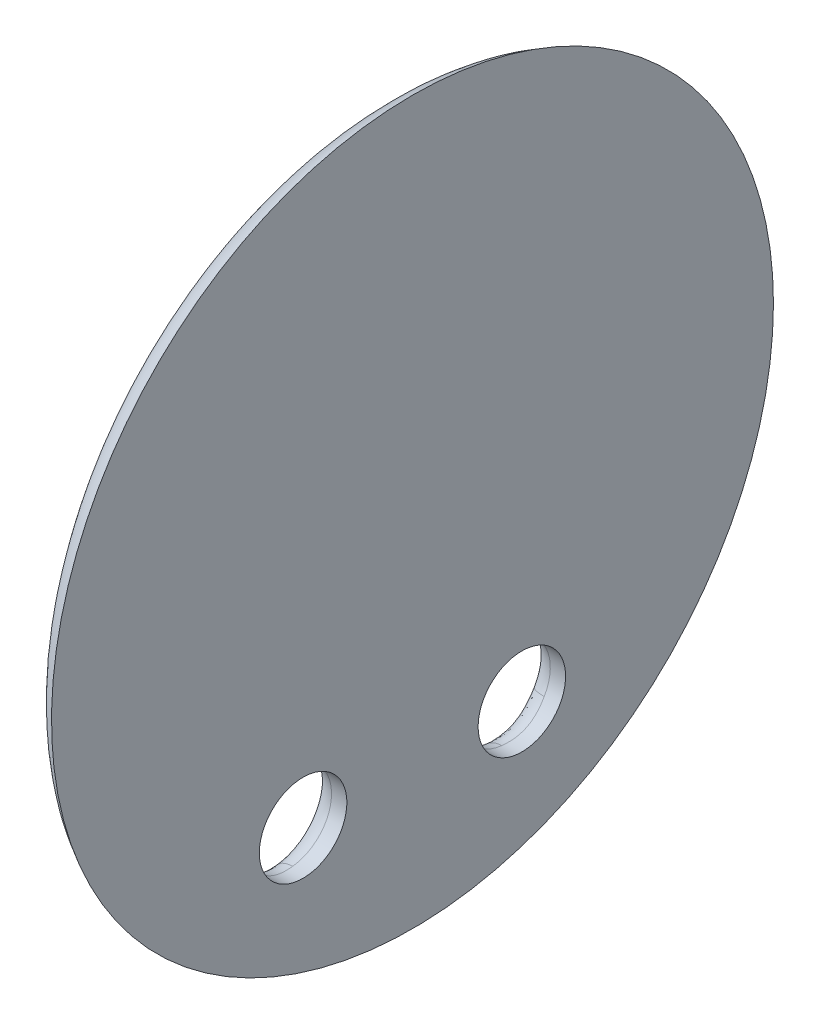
ISO-10303-21;
HEADER;
FILE_DESCRIPTION(('STEP AP214'),'2;1');
FILE_NAME('part.step','',(''),(''),'','','');
FILE_SCHEMA(('AUTOMOTIVE_DESIGN { 1 0 10303 214 1 1 1 1 }'));
ENDSEC;
DATA;
#1=APPLICATION_CONTEXT('core data for automotive mechanical design processes');
#2=APPLICATION_PROTOCOL_DEFINITION('international standard','automotive_design',2000,#1);
#3=PRODUCT_CONTEXT('',#1,'mechanical');
#4=PRODUCT('Part','Part','',(#3));
#5=PRODUCT_RELATED_PRODUCT_CATEGORY('part','',(#4));
#6=PRODUCT_DEFINITION_FORMATION('','',#4);
#7=PRODUCT_DEFINITION_CONTEXT('part definition',#1,'design');
#8=PRODUCT_DEFINITION('design','',#6,#7);
#9=PRODUCT_DEFINITION_SHAPE('','',#8);
#10=(LENGTH_UNIT() NAMED_UNIT(*) SI_UNIT(.MILLI.,.METRE.));
#11=(NAMED_UNIT(*) PLANE_ANGLE_UNIT() SI_UNIT($,.RADIAN.));
#12=(NAMED_UNIT(*) SI_UNIT($,.STERADIAN.) SOLID_ANGLE_UNIT());
#13=UNCERTAINTY_MEASURE_WITH_UNIT(LENGTH_MEASURE(1.E-05),#10,'distance_accuracy_value','');
#14=(GEOMETRIC_REPRESENTATION_CONTEXT(3) GLOBAL_UNCERTAINTY_ASSIGNED_CONTEXT((#13)) GLOBAL_UNIT_ASSIGNED_CONTEXT((#10,
#11,#12)) REPRESENTATION_CONTEXT('',''));
#15=CARTESIAN_POINT('',(0.,0.,0.));
#16=DIRECTION('',(0.,0.,1.));
#17=DIRECTION('',(1.,0.,0.));
#18=AXIS2_PLACEMENT_3D('',#15,#16,#17);
#19=CARTESIAN_POINT('',(-1.7,0.,0.));
#20=DIRECTION('',(1.,0.,0.));
#21=DIRECTION('',(0.,0.,-1.));
#22=AXIS2_PLACEMENT_3D('',#19,#20,#21);
#23=PLANE('',#22);
#24=CARTESIAN_POINT('',(-1.69999999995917,-11.5252431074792,-7.58334125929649));
#25=CARTESIAN_POINT('',(-1.6999999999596,-11.4241481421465,-7.73699016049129));
#26=CARTESIAN_POINT('',(-1.69999999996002,-11.3199772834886,-7.88861501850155));
#27=CARTESIAN_POINT('',(-1.69999999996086,-11.1056579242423,-8.18757955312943));
#28=CARTESIAN_POINT('',(-1.69999999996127,-10.99550942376,-8.334919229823));
#29=CARTESIAN_POINT('',(-1.6999999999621,-10.769408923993,-8.62507630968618));
#30=CARTESIAN_POINT('',(-1.69999999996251,-10.6534569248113,-8.76789371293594));
#31=CARTESIAN_POINT('',(-1.69999999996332,-10.4159354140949,-9.04877822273));
#32=CARTESIAN_POINT('',(-1.69999999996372,-10.2943659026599,-9.1868453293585));
#33=CARTESIAN_POINT('',(-1.69999999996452,-10.0458036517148,-9.45800832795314));
#34=CARTESIAN_POINT('',(-1.69999999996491,-9.91881091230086,-9.5911042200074));
#35=CARTESIAN_POINT('',(-1.6999999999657,-9.65960534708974,-9.85211195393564));
#36=CARTESIAN_POINT('',(-1.69999999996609,-9.52739252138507,-9.9800237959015));
#37=CARTESIAN_POINT('',(-1.69999999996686,-9.2579582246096,-10.2304588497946));
#38=CARTESIAN_POINT('',(-1.69999999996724,-9.12073675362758,-10.3529820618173));
#39=CARTESIAN_POINT('',(-1.699999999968,-8.84150463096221,-10.5924439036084));
#40=CARTESIAN_POINT('',(-1.69999999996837,-8.69949397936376,-10.7093825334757));
#41=CARTESIAN_POINT('',(-1.69999999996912,-8.4109106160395,-10.9374881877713));
#42=CARTESIAN_POINT('',(-1.69999999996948,-8.26433790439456,-11.0486552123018));
#43=CARTESIAN_POINT('',(-1.69999999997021,-7.96686483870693,-11.2650398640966));
#44=CARTESIAN_POINT('',(-1.69999999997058,-7.81596448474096,-11.3702574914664));
#45=CARTESIAN_POINT('',(-1.69999999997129,-7.51007747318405,-11.5745750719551));
#46=CARTESIAN_POINT('',(-1.69999999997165,-7.35509081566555,-11.6736750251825));
#47=CARTESIAN_POINT('',(-1.69999999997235,-7.04127907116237,-11.8655987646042));
#48=CARTESIAN_POINT('',(-1.6999999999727,-6.88245398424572,-11.9584225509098));
#49=CARTESIAN_POINT('',(-1.69999999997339,-6.56121939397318,-12.1376455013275));
#50=CARTESIAN_POINT('',(-1.69999999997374,-6.39880989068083,-12.2240446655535));
#51=CARTESIAN_POINT('',(-1.69999999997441,-6.07066621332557,-12.3902801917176));
#52=CARTESIAN_POINT('',(-1.69999999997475,-5.9049320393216,-12.470116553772));
#53=CARTESIAN_POINT('',(-1.69999999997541,-5.57040408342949,-12.6230987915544));
#54=CARTESIAN_POINT('',(-1.69999999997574,-5.40161030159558,-12.696244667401));
#55=CARTESIAN_POINT('',(-1.69999999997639,-5.0612330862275,-12.8357289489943));
#56=CARTESIAN_POINT('',(-1.69999999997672,-4.88964965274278,-12.9020673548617));
#57=CARTESIAN_POINT('',(-1.69999999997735,-4.54396755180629,-13.0278306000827));
#58=CARTESIAN_POINT('',(-1.69999999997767,-4.3698688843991,-13.0872554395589));
#59=CARTESIAN_POINT('',(-1.69999999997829,-4.01943475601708,-13.199096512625));
#60=CARTESIAN_POINT('',(-1.6999999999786,-3.8430992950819,-13.2515127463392));
#61=CARTESIAN_POINT('',(-1.69999999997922,-3.48847359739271,-13.3492527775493));
#62=CARTESIAN_POINT('',(-1.69999999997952,-3.31018336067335,-13.3945765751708));
#63=CARTESIAN_POINT('',(-1.69999999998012,-2.95193325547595,-13.4780592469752));
#64=CARTESIAN_POINT('',(-1.69999999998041,-2.77197338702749,-13.516218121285));
#65=CARTESIAN_POINT('',(-1.699999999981,-2.41067183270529,-13.585309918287));
#66=CARTESIAN_POINT('',(-1.69999999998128,-2.22933014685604,-13.6162428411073));
#67=CARTESIAN_POINT('',(-1.69999999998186,-1.86555498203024,-13.6708332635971));
#68=CARTESIAN_POINT('',(-1.69999999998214,-1.68312150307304,-13.6944907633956));
#69=CARTESIAN_POINT('',(-1.6999999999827,-1.31745452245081,-13.7344925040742));
#70=CARTESIAN_POINT('',(-1.69999999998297,-1.13422102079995,-13.7508367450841));
#71=CARTESIAN_POINT('',(-1.69999999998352,-0.767247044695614,-13.7761858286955));
#72=CARTESIAN_POINT('',(-1.69999999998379,-0.583506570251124,-13.7851906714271));
#73=CARTESIAN_POINT('',(-1.69999999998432,-0.215812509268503,-13.7958465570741));
#74=CARTESIAN_POINT('',(-1.69999999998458,-0.0318589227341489,-13.7974976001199));
#75=CARTESIAN_POINT('',(-1.6999999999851,0.335967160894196,-13.793443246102));
#76=CARTESIAN_POINT('',(-1.69999999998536,0.519839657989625,-13.7877378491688));
#77=CARTESIAN_POINT('',(-1.69999999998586,0.8872094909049,-13.7689797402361));
#78=CARTESIAN_POINT('',(-1.69999999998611,1.0707068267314,-13.755927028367));
#79=CARTESIAN_POINT('',(-1.6999999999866,1.4370328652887,-13.7224951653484));
#80=CARTESIAN_POINT('',(-1.69999999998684,1.61986156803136,-13.7021160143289));
#81=CARTESIAN_POINT('',(-1.69999999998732,1.98455793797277,-13.6540638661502));
#82=CARTESIAN_POINT('',(-1.69999999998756,2.16642560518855,-13.6263908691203));
#83=CARTESIAN_POINT('',(-1.69999999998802,2.52890903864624,-13.5637952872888));
#84=CARTESIAN_POINT('',(-1.69999999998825,2.70952480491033,-13.5288727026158));
#85=CARTESIAN_POINT('',(-1.6999999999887,3.0692155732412,-13.4518337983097));
#86=CARTESIAN_POINT('',(-1.69999999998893,3.24829057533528,-13.4097174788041));
#87=CARTESIAN_POINT('',(-1.69999999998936,3.60461341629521,-13.3183584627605));
#88=CARTESIAN_POINT('',(-1.69999999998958,3.78186125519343,-13.2691157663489));
#89=CARTESIAN_POINT('',(-1.69999999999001,4.13424629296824,-13.1635827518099));
#90=CARTESIAN_POINT('',(-1.69999999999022,4.30938349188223,-13.1072924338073));
#91=CARTESIAN_POINT('',(-1.69999999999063,4.65726714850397,-12.9877542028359));
#92=CARTESIAN_POINT('',(-1.69999999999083,4.83001360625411,-12.9245062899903));
#93=CARTESIAN_POINT('',(-1.69999999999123,5.17283950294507,-12.7911540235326));
#94=CARTESIAN_POINT('',(-1.69999999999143,5.34291894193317,-12.7210496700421));
#95=CARTESIAN_POINT('',(-1.69999999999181,5.6801387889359,-12.5740966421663));
#96=CARTESIAN_POINT('',(-1.699999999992,5.84727919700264,-12.4972479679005));
#97=CARTESIAN_POINT('',(-1.69999999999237,6.17835367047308,-12.3369292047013));
#98=CARTESIAN_POINT('',(-1.69999999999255,6.34228773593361,-12.2534591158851));
#99=CARTESIAN_POINT('',(-1.69999999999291,6.66668734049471,-12.0800310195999));
#100=CARTESIAN_POINT('',(-1.69999999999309,6.82715287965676,-11.9900730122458));
#101=CARTESIAN_POINT('',(-1.69999999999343,7.14435879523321,-11.8038129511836));
#102=CARTESIAN_POINT('',(-1.6999999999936,7.30109917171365,-11.707510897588));
#103=CARTESIAN_POINT('',(-1.69999999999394,7.61060408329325,-11.5087167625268));
#104=CARTESIAN_POINT('',(-1.6999999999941,7.7633686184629,-11.4062246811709));
#105=CARTESIAN_POINT('',(-1.69999999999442,8.06467752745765,-11.1952144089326));
#106=CARTESIAN_POINT('',(-1.69999999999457,8.21322190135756,-11.086696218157));
#107=CARTESIAN_POINT('',(-1.69999999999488,8.50585291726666,-10.8638072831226));
#108=CARTESIAN_POINT('',(-1.69999999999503,8.64993955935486,-10.7494365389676));
#109=CARTESIAN_POINT('',(-1.69999999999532,8.93342467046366,-10.5150254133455));
#110=CARTESIAN_POINT('',(-1.69999999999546,9.07282313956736,-10.3949850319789));
#111=CARTESIAN_POINT('',(-1.69999999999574,9.34670896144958,-10.1494266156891));
#112=CARTESIAN_POINT('',(-1.69999999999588,9.48119631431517,-10.023908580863));
#113=CARTESIAN_POINT('',(-1.69999999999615,9.74504481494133,-9.76759560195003));
#114=CARTESIAN_POINT('',(-1.69999999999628,9.87440596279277,-9.63680065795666));
#115=CARTESIAN_POINT('',(-1.69999999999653,10.1277951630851,-9.37014304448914));
#116=CARTESIAN_POINT('',(-1.69999999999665,10.2518232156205,-9.23428037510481));
#117=CARTESIAN_POINT('',(-1.69999999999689,10.4943478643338,-8.95770459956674));
#118=CARTESIAN_POINT('',(-1.69999999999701,10.6128444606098,-8.81699149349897));
#119=CARTESIAN_POINT('',(-1.69999999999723,10.8441166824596,-8.53093989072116));
#120=CARTESIAN_POINT('',(-1.69999999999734,10.9568923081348,-8.38560139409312));
#121=CARTESIAN_POINT('',(-1.69999999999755,11.1765422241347,-8.09053145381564));
#122=CARTESIAN_POINT('',(-1.69999999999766,11.2834165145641,-7.94080001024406));
#123=CARTESIAN_POINT('',(-1.69999999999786,11.4910928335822,-7.63718364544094));
#124=CARTESIAN_POINT('',(-1.69999999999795,11.5918948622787,-7.48329872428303));
#125=CARTESIAN_POINT('',(-1.69999999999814,11.7872654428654,-7.17162151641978));
#126=CARTESIAN_POINT('',(-1.69999999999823,11.8818339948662,-7.01382922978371));
#127=CARTESIAN_POINT('',(-1.6999999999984,12.0645863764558,-6.69458965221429));
#128=CARTESIAN_POINT('',(-1.69999999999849,12.1527702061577,-6.53314236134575));
#129=CARTESIAN_POINT('',(-1.69999999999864,12.3226121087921,-6.20685098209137));
#130=CARTESIAN_POINT('',(-1.69999999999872,12.4042701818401,-6.04200689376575));
#131=CARTESIAN_POINT('',(-1.69999999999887,12.5609299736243,-5.70918555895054));
#132=CARTESIAN_POINT('',(-1.69999999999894,12.6359316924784,-5.5412083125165));
#133=CARTESIAN_POINT('',(-1.69999999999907,12.7791588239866,-5.2023893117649));
#134=CARTESIAN_POINT('',(-1.69999999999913,12.8473842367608,-5.03154755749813));
#135=CARTESIAN_POINT('',(-1.69999999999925,12.9769496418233,-4.68727277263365));
#136=CARTESIAN_POINT('',(-1.69999999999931,13.0382896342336,-4.51383974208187));
#137=CARTESIAN_POINT('',(-1.69999999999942,13.1539860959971,-4.16465978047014));
#138=CARTESIAN_POINT('',(-1.69999999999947,13.2083425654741,-3.9889128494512));
#139=CARTESIAN_POINT('',(-1.69999999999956,13.3099850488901,-3.63538616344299));
#140=CARTESIAN_POINT('',(-1.6999999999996,13.3572710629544,-3.45760640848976));
#141=CARTESIAN_POINT('',(-1.69999999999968,13.4446970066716,-3.10029840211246));
#142=CARTESIAN_POINT('',(-1.69999999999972,13.4848369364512,-2.92077015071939));
#143=CARTESIAN_POINT('',(-1.69999999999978,13.5579065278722,-2.56025227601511));
#144=CARTESIAN_POINT('',(-1.69999999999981,13.5908361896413,-2.37926265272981));
#145=CARTESIAN_POINT('',(-1.69999999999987,13.6494325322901,-2.01611149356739));
#146=CARTESIAN_POINT('',(-1.69999999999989,13.6750992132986,-1.83394995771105));
#147=CARTESIAN_POINT('',(-1.69999999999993,13.7191287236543,-1.46874631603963));
#148=CARTESIAN_POINT('',(-1.69999999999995,13.737491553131,-1.28570421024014));
#149=CARTESIAN_POINT('',(-1.69999999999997,13.7668833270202,-0.919032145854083));
#150=CARTESIAN_POINT('',(-1.69999999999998,13.7779122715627,-0.735402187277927));
#151=CARTESIAN_POINT('',(-1.7,13.7926211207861,-0.367848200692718));
#152=CARTESIAN_POINT('',(-1.7,13.7963010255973,-0.183924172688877));
#153=CARTESIAN_POINT('',(-1.7,13.79629883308,0.));
#154=B_SPLINE_CURVE_WITH_KNOTS('',3,(#24,#25,#26,#27,#28,#29,#30,#31,#32,#33,#34,#35,#36,#37,
#38,#39,#40,#41,#42,#43,#44,#45,#46,#47,#48,#49,#50,#51,#52,#53,#54,#55,#56,#57,#58,#59,#60,#61,
#62,#63,#64,#65,#66,#67,#68,#69,#70,#71,#72,#73,#74,#75,#76,#77,#78,#79,#80,#81,#82,#83,#84,#85,
#86,#87,#88,#89,#90,#91,#92,#93,#94,#95,#96,#97,#98,#99,#100,#101,#102,#103,#104,#105,#106,#107,
#108,#109,#110,#111,#112,#113,#114,#115,#116,#117,#118,#119,#120,#121,#122,#123,#124,#125,#126,
#127,#128,#129,#130,#131,#132,#133,#134,#135,#136,#137,#138,#139,#140,#141,#142,#143,#144,#145,
#146,#147,#148,#149,#150,#151,#152,#153),.UNSPECIFIED.,.F.,.F.,(4,2,2,2,2,2,2,2,2,2,2,2,2,2,2,2,
2,2,2,2,2,2,2,2,2,2,2,2,2,2,2,2,2,2,2,2,2,2,2,2,2,2,2,2,2,2,2,2,2,2,2,2,2,2,2,2,2,2,2,2,2,2,2,2,
4),(0.,0.55173611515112,1.10347222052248,1.65520831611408,2.20694440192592,2.75868047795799,
3.31041654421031,3.86215260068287,4.41388864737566,4.96562468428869,5.51736071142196,
6.06909672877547,6.62083273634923,7.17256873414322,7.72430472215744,8.27604070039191,
8.82777666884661,9.37951262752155,9.93124857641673,10.4829845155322,11.0347204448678,
11.5864563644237,12.1381922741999,12.6899281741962,13.2416640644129,13.7933999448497,
14.3451358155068,14.8968716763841,15.4486075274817,16.0003433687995,16.5520792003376,
17.1038150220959,17.6555508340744,18.2072866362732,18.7590224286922,19.3107582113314,
19.8624939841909,20.4142297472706,20.9659655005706,21.5177012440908,22.0694369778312,
22.6211727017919,23.1729084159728,23.7246441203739,24.2763798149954,24.828115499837,
25.3798511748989,25.931586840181,26.4833224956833,27.0350581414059,27.5867937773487,
28.1385294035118,28.6902650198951,29.2420006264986,29.7937362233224,30.3454718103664,
30.8972073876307,31.4489429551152,32.0006785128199,32.5524140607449,33.1041495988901,
33.6558851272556,34.2076206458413,34.7593561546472,35.3110916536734),.UNSPECIFIED.);
#155=CARTESIAN_POINT('',(-1.70000036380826,-11.5252431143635,-7.58334127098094));
#156=VERTEX_POINT('',#155);
#157=CARTESIAN_POINT('',(-1.7,13.79629883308,0.));
#158=VERTEX_POINT('',#157);
#159=EDGE_CURVE('E242',#156,#158,#154,.T.);
#160=ORIENTED_EDGE('',*,*,#159,.F.);
#161=CARTESIAN_POINT('',(-1.69999999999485,-10.,-5.));
#162=DIRECTION('',(-1.,0.,0.));
#163=DIRECTION('',(0.,-0.993938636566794,0.10993628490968));
#164=AXIS2_PLACEMENT_3D('',#161,#162,#163);
#165=CIRCLE('',#164,3.00000320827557);
#166=CARTESIAN_POINT('',(-1.70000036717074,-12.9818190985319,-4.6701907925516));
#167=VERTEX_POINT('',#166);
#168=EDGE_CURVE('E253',#167,#156,#165,.T.);
#169=ORIENTED_EDGE('',*,*,#168,.F.);
#170=CARTESIAN_POINT('',(-1.7,-13.79629883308,0.));
#171=CARTESIAN_POINT('',(-1.7,-13.7963023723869,-0.198513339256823));
#172=CARTESIAN_POINT('',(-1.69999999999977,-13.792015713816,-0.397026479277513));
#173=CARTESIAN_POINT('',(-1.69999999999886,-13.7748825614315,-0.793683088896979));
#174=CARTESIAN_POINT('',(-1.69999999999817,-13.7620360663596,-0.991826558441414));
#175=CARTESIAN_POINT('',(-1.69999999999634,-13.7278037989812,-1.38737452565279));
#176=CARTESIAN_POINT('',(-1.6999999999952,-13.7064180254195,-1.5847790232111));
#177=CARTESIAN_POINT('',(-1.69999999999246,-13.6551479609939,-1.97848131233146));
#178=CARTESIAN_POINT('',(-1.69999999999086,-13.6252636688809,-2.17477910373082));
#179=CARTESIAN_POINT('',(-1.69999999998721,-13.5570519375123,-2.56590223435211));
#180=CARTESIAN_POINT('',(-1.69999999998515,-13.5187244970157,-2.7607275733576));
#181=CARTESIAN_POINT('',(-1.69999999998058,-13.4336981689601,-3.14854290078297));
#182=CARTESIAN_POINT('',(-1.69999999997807,-13.3869992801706,-3.34153288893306));
#183=CARTESIAN_POINT('',(-1.69999999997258,-13.2853161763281,-3.72531769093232));
#184=CARTESIAN_POINT('',(-1.69999999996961,-13.2303319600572,-3.91611250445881));
#185=CARTESIAN_POINT('',(-1.69999999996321,-13.1121838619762,-4.29515249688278));
#186=CARTESIAN_POINT('',(-1.69999999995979,-13.0490199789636,-4.48339767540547));
#187=CARTESIAN_POINT('',(-1.69999999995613,-12.9818190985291,-4.67019079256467));
#188=B_SPLINE_CURVE_WITH_KNOTS('',3,(#170,#171,#172,#173,#174,#175,#176,#177,#178,#179,#180,
#181,#182,#183,#184,#185,#186,#187),.UNSPECIFIED.,.F.,.F.,(4,2,2,2,2,2,2,2,4),(0.,
0.595493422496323,1.19098693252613,1.78648053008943,2.38197421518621,2.97746798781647,
3.57296184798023,4.16845579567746,4.76394983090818),.UNSPECIFIED.);
#189=CARTESIAN_POINT('',(-1.7,-13.79629883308,0.));
#190=VERTEX_POINT('',#189);
#191=EDGE_CURVE('E235',#190,#167,#188,.T.);
#192=ORIENTED_EDGE('',*,*,#191,.F.);
#193=CARTESIAN_POINT('',(-1.69999999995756,-12.98181899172,4.670190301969));
#194=CARTESIAN_POINT('',(-1.6999999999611,-13.049019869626,4.48339720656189));
#195=CARTESIAN_POINT('',(-1.69999999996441,-13.1121837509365,4.29515204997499));
#196=CARTESIAN_POINT('',(-1.6999999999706,-13.2303318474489,3.91611210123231));
#197=CARTESIAN_POINT('',(-1.69999999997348,-13.2853160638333,3.72531730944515));
#198=CARTESIAN_POINT('',(-1.69999999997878,-13.386999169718,3.34153255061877));
#199=CARTESIAN_POINT('',(-1.69999999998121,-13.4336980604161,3.14854258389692));
#200=CARTESIAN_POINT('',(-1.69999999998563,-13.5187243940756,2.7607272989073));
#201=CARTESIAN_POINT('',(-1.69999999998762,-13.5570518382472,2.56590198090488));
#202=CARTESIAN_POINT('',(-1.69999999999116,-13.6252635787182,2.17477889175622));
#203=CARTESIAN_POINT('',(-1.69999999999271,-13.6551478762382,1.97848112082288));
#204=CARTESIAN_POINT('',(-1.69999999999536,-13.7064179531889,1.58477887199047));
#205=CARTESIAN_POINT('',(-1.69999999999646,-13.7278037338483,1.38737439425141));
#206=CARTESIAN_POINT('',(-1.69999999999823,-13.7620360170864,0.991826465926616));
#207=CARTESIAN_POINT('',(-1.69999999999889,-13.7748825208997,0.793683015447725));
#208=CARTESIAN_POINT('',(-1.69999999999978,-13.792015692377,0.397026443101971));
#209=CARTESIAN_POINT('',(-1.7,-13.7963023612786,0.198513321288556));
#210=CARTESIAN_POINT('',(-1.7,-13.79629883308,0.));
#211=B_SPLINE_CURVE_WITH_KNOTS('',3,(#193,#194,#195,#196,#197,#198,#199,#200,#201,#202,#203,
#204,#205,#206,#207,#208,#209,#210),.UNSPECIFIED.,.F.,.F.,(4,2,2,2,2,2,2,2,4),(0.,
0.595493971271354,1.19098785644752,1.78648165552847,2.38197536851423,2.97746899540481,
3.57296253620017,4.16845599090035,4.76394935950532),.UNSPECIFIED.);
#212=CARTESIAN_POINT('',(-1.70000036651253,-12.9818189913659,4.67019030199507));
#213=VERTEX_POINT('',#212);
#214=EDGE_CURVE('E313',#213,#190,#211,.T.);
#215=ORIENTED_EDGE('',*,*,#214,.F.);
#216=CARTESIAN_POINT('',(-1.69999999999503,-10.,5.));
#217=DIRECTION('',(-1.,0.,0.));
#218=DIRECTION('',(0.,-0.508413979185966,0.861112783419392));
#219=AXIS2_PLACEMENT_3D('',#216,#217,#218);
#220=CIRCLE('',#219,3.00000315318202);
#221=CARTESIAN_POINT('',(-1.70000036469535,-11.5252435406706,7.58334106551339));
#222=VERTEX_POINT('',#221);
#223=EDGE_CURVE('E83',#222,#213,#220,.T.);
#224=ORIENTED_EDGE('',*,*,#223,.F.);
#225=CARTESIAN_POINT('',(-1.7,13.79629883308,0.));
#226=CARTESIAN_POINT('',(-1.7,13.7963010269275,0.183924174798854));
#227=CARTESIAN_POINT('',(-1.7,13.7926211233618,0.367848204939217));
#228=CARTESIAN_POINT('',(-1.69999999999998,13.7779122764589,0.735402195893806));
#229=CARTESIAN_POINT('',(-1.69999999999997,13.7668833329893,0.919032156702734));
#230=CARTESIAN_POINT('',(-1.69999999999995,13.7374915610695,1.28570422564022));
#231=CARTESIAN_POINT('',(-1.69999999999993,13.7191287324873,1.46874633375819));
#232=CARTESIAN_POINT('',(-1.69999999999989,13.6750992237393,1.83394998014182));
#233=CARTESIAN_POINT('',(-1.69999999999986,13.6494325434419,2.01611151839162));
#234=CARTESIAN_POINT('',(-1.69999999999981,13.5908362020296,2.37926268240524));
#235=CARTESIAN_POINT('',(-1.69999999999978,13.5579065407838,2.56025230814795));
#236=CARTESIAN_POINT('',(-1.69999999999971,13.48483695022,2.92077018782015));
#237=CARTESIAN_POINT('',(-1.69999999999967,13.4446970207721,3.10029844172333));
#238=CARTESIAN_POINT('',(-1.69999999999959,13.3572710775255,3.45760645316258));
#239=CARTESIAN_POINT('',(-1.69999999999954,13.3099850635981,3.63538621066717));
#240=CARTESIAN_POINT('',(-1.69999999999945,13.2083425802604,3.98891290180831));
#241=CARTESIAN_POINT('',(-1.6999999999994,13.1539861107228,4.16465983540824));
#242=CARTESIAN_POINT('',(-1.69999999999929,13.0382896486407,4.5138398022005));
#243=CARTESIAN_POINT('',(-1.69999999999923,12.9769496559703,4.68727283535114));
#244=CARTESIAN_POINT('',(-1.6999999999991,12.8473842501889,5.03154762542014));
#245=CARTESIAN_POINT('',(-1.69999999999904,12.7791588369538,5.20238938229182));
#246=CARTESIAN_POINT('',(-1.6999999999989,12.6359317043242,5.54120838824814));
#247=CARTESIAN_POINT('',(-1.69999999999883,12.5609299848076,5.70918563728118));
#248=CARTESIAN_POINT('',(-1.69999999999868,12.4042701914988,6.0420069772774));
#249=CARTESIAN_POINT('',(-1.6999999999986,12.3226121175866,6.20685106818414));
#250=CARTESIAN_POINT('',(-1.69999999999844,12.1527702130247,6.53314245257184));
#251=CARTESIAN_POINT('',(-1.69999999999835,12.0645863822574,6.69458974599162));
#252=CARTESIAN_POINT('',(-1.69999999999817,11.8818339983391,7.01382932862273));
#253=CARTESIAN_POINT('',(-1.69999999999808,11.787265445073,7.17162161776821));
#254=CARTESIAN_POINT('',(-1.69999999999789,11.5918948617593,7.48329883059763));
#255=CARTESIAN_POINT('',(-1.69999999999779,11.4910928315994,7.63718375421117));
#256=CARTESIAN_POINT('',(-1.69999999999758,11.2834165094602,7.94080012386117));
#257=CARTESIAN_POINT('',(-1.69999999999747,11.1765422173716,8.0905315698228));
#258=CARTESIAN_POINT('',(-1.69999999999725,10.9568922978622,8.38560151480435));
#259=CARTESIAN_POINT('',(-1.69999999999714,10.8441166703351,8.53094001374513));
#260=CARTESIAN_POINT('',(-1.69999999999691,10.6128444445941,8.81699162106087));
#261=CARTESIAN_POINT('',(-1.69999999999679,10.4943478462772,8.9577047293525));
#262=CARTESIAN_POINT('',(-1.69999999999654,10.2518231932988,9.23428050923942));
#263=CARTESIAN_POINT('',(-1.69999999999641,10.1277951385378,9.37014318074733));
#264=CARTESIAN_POINT('',(-1.69999999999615,9.87440593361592,9.63680079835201));
#265=CARTESIAN_POINT('',(-1.69999999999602,9.74504478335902,9.76759574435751));
#266=CARTESIAN_POINT('',(-1.69999999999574,9.48119627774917,10.0239087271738));
#267=CARTESIAN_POINT('',(-1.6999999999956,9.34670892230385,10.1494267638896));
#268=CARTESIAN_POINT('',(-1.69999999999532,9.07282309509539,10.3949851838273));
#269=CARTESIAN_POINT('',(-1.69999999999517,8.93342462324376,10.5150255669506));
#270=CARTESIAN_POINT('',(-1.69999999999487,8.64993950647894,10.7494366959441));
#271=CARTESIAN_POINT('',(-1.69999999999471,8.5058528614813,10.8638074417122));
#272=CARTESIAN_POINT('',(-1.6999999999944,8.21322183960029,11.086696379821));
#273=CARTESIAN_POINT('',(-1.69999999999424,8.06467746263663,11.1952145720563));
#274=CARTESIAN_POINT('',(-1.69999999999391,7.76336854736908,11.4062248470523));
#275=CARTESIAN_POINT('',(-1.69999999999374,7.61060400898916,11.5087169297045));
#276=CARTESIAN_POINT('',(-1.69999999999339,7.30109909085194,11.7075110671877));
#277=CARTESIAN_POINT('',(-1.69999999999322,7.144358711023,11.8038131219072));
#278=CARTESIAN_POINT('',(-1.69999999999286,6.82715278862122,11.9900731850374));
#279=CARTESIAN_POINT('',(-1.69999999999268,6.66668724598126,12.0800311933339));
#280=CARTESIAN_POINT('',(-1.69999999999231,6.3422876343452,12.2534592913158));
#281=CARTESIAN_POINT('',(-1.69999999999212,6.17835356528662,12.3369293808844));
#282=CARTESIAN_POINT('',(-1.69999999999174,5.84727908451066,12.4972481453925));
#283=CARTESIAN_POINT('',(-1.69999999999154,5.68013867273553,12.5740968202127));
#284=CARTESIAN_POINT('',(-1.69999999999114,5.34291881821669,12.7210498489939));
#285=CARTESIAN_POINT('',(-1.69999999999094,5.17283937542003,12.7911542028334));
#286=CARTESIAN_POINT('',(-1.69999999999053,4.8300134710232,12.9245064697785));
#287=CARTESIAN_POINT('',(-1.69999999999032,4.65726700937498,12.9877543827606));
#288=CARTESIAN_POINT('',(-1.69999999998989,4.30938334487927,13.1072926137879));
#289=CARTESIAN_POINT('',(-1.69999999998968,4.13424614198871,13.1635829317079));
#290=CARTESIAN_POINT('',(-1.69999999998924,3.78186109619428,13.2691159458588));
#291=CARTESIAN_POINT('',(-1.69999999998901,3.60461325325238,13.3183586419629));
#292=CARTESIAN_POINT('',(-1.69999999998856,3.24829040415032,13.4097176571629));
#293=CARTESIAN_POINT('',(-1.69999999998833,3.06921539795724,13.4518339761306));
#294=CARTESIAN_POINT('',(-1.69999999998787,2.70952462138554,13.5288728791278));
#295=CARTESIAN_POINT('',(-1.69999999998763,2.52890885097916,13.5637954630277));
#296=CARTESIAN_POINT('',(-1.69999999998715,2.16642540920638,13.6263910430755));
#297=CARTESIAN_POINT('',(-1.6999999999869,1.98455773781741,13.6540640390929));
#298=CARTESIAN_POINT('',(-1.69999999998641,1.61986135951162,13.7021161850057));
#299=CARTESIAN_POINT('',(-1.69999999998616,1.43703265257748,13.7224953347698));
#300=CARTESIAN_POINT('',(-1.69999999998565,1.07070660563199,13.7559271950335));
#301=CARTESIAN_POINT('',(-1.69999999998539,0.88720926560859,13.7689799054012));
#302=CARTESIAN_POINT('',(-1.69999999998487,0.519839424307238,13.7877380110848));
#303=CARTESIAN_POINT('',(-1.69999999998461,0.335966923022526,13.7934434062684));
#304=CARTESIAN_POINT('',(-1.69999999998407,-0.0318591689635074,13.7974977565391));
#305=CARTESIAN_POINT('',(-1.6999999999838,-0.215812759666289,13.7958467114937));
#306=CARTESIAN_POINT('',(-1.69999999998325,-0.583506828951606,13.7851908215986));
#307=CARTESIAN_POINT('',(-1.69999999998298,-0.767247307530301,13.7761859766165));
#308=CARTESIAN_POINT('',(-1.69999999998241,-1.13422129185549,13.7508368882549));
#309=CARTESIAN_POINT('',(-1.69999999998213,-1.31745479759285,13.7344926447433));
#310=CARTESIAN_POINT('',(-1.69999999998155,-1.68312178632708,13.6944908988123));
#311=CARTESIAN_POINT('',(-1.69999999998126,-1.86555526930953,13.6708333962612));
#312=CARTESIAN_POINT('',(-1.69999999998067,-2.22933044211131,13.6162429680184));
#313=CARTESIAN_POINT('',(-1.69999999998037,-2.41067213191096,13.5853100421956));
#314=CARTESIAN_POINT('',(-1.69999999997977,-2.77197369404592,13.5162182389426));
#315=CARTESIAN_POINT('',(-1.69999999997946,-2.95193356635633,13.4780593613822));
#316=CARTESIAN_POINT('',(-1.69999999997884,-3.31018367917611,13.394576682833));
#317=CARTESIAN_POINT('',(-1.69999999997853,-3.48847391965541,13.3492528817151));
#318=CARTESIAN_POINT('',(-1.6999999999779,-3.84309962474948,13.2515128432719));
#319=CARTESIAN_POINT('',(-1.69999999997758,-4.01943508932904,13.1990966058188));
#320=CARTESIAN_POINT('',(-1.69999999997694,-4.3698692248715,13.0872555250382));
#321=CARTESIAN_POINT('',(-1.69999999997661,-4.54396789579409,13.0278306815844));
#322=CARTESIAN_POINT('',(-1.69999999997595,-4.88965000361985,12.9020674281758));
#323=CARTESIAN_POINT('',(-1.69999999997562,-5.06123344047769,12.8357290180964));
#324=CARTESIAN_POINT('',(-1.69999999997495,-5.40161066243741,12.696244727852));
#325=CARTESIAN_POINT('',(-1.69999999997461,-5.57040444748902,12.6230988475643));
#326=CARTESIAN_POINT('',(-1.69999999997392,-5.90493240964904,12.4701166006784));
#327=CARTESIAN_POINT('',(-1.69999999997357,-6.07066658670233,12.3902802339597));
#328=CARTESIAN_POINT('',(-1.69999999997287,-6.39881026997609,12.224044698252));
#329=CARTESIAN_POINT('',(-1.69999999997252,-6.56121977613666,12.1376455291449));
#330=CARTESIAN_POINT('',(-1.69999999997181,-6.88245437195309,11.9584225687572));
#331=CARTESIAN_POINT('',(-1.69999999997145,-7.04127946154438,11.8655987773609));
#332=CARTESIAN_POINT('',(-1.69999999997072,-7.35509121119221,11.6736750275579));
#333=CARTESIAN_POINT('',(-1.69999999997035,-7.51007787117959,11.5745750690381));
#334=CARTESIAN_POINT('',(-1.69999999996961,-7.81596488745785,11.370257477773));
#335=CARTESIAN_POINT('',(-1.69999999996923,-7.96686524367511,11.2650398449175));
#336=CARTESIAN_POINT('',(-1.69999999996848,-8.26433831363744,11.0486551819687));
#337=CARTESIAN_POINT('',(-1.6999999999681,-8.41091102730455,10.9374881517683));
#338=CARTESIAN_POINT('',(-1.69999999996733,-8.69949439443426,10.7093824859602));
#339=CARTESIAN_POINT('',(-1.69999999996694,-8.84150504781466,10.5924438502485));
#340=CARTESIAN_POINT('',(-1.69999999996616,-9.12073717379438,10.3529819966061));
#341=CARTESIAN_POINT('',(-1.69999999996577,-9.25795864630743,10.2304587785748));
#342=CARTESIAN_POINT('',(-1.69999999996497,-9.52739294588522,9.9800237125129));
#343=CARTESIAN_POINT('',(-1.69999999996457,-9.65960577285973,9.85211186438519));
#344=CARTESIAN_POINT('',(-1.69999999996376,-9.91881134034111,9.59110411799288));
#345=CARTESIAN_POINT('',(-1.69999999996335,-10.0458040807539,9.4580082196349));
#346=CARTESIAN_POINT('',(-1.69999999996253,-10.2943663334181,9.18684520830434));
#347=CARTESIAN_POINT('',(-1.69999999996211,-10.4159358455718,9.04877809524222));
#348=CARTESIAN_POINT('',(-1.69999999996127,-10.6534573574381,8.76789357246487));
#349=CARTESIAN_POINT('',(-1.69999999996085,-10.7694093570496,8.62507616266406));
#350=CARTESIAN_POINT('',(-1.69999999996,-10.9955098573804,8.33491906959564));
#351=CARTESIAN_POINT('',(-1.69999999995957,-11.1056583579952,8.18757938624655));
#352=CARTESIAN_POINT('',(-1.69999999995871,-11.3199777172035,7.88861483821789));
#353=CARTESIAN_POINT('',(-1.69999999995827,-11.4241485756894,7.73698997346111));
#354=CARTESIAN_POINT('',(-1.69999999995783,-11.52524354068,7.583341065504));
#355=B_SPLINE_CURVE_WITH_KNOTS('',3,(#225,#226,#227,#228,#229,#230,#231,#232,#233,#234,#235,
#236,#237,#238,#239,#240,#241,#242,#243,#244,#245,#246,#247,#248,#249,#250,#251,#252,#253,#254,
#255,#256,#257,#258,#259,#260,#261,#262,#263,#264,#265,#266,#267,#268,#269,#270,#271,#272,#273,
#274,#275,#276,#277,#278,#279,#280,#281,#282,#283,#284,#285,#286,#287,#288,#289,#290,#291,#292,
#293,#294,#295,#296,#297,#298,#299,#300,#301,#302,#303,#304,#305,#306,#307,#308,#309,#310,#311,
#312,#313,#314,#315,#316,#317,#318,#319,#320,#321,#322,#323,#324,#325,#326,#327,#328,#329,#330,
#331,#332,#333,#334,#335,#336,#337,#338,#339,#340,#341,#342,#343,#344,#345,#346,#347,#348,#349,
#350,#351,#352,#353,#354),.UNSPECIFIED.,.F.,.F.,(4,2,2,2,2,2,2,2,2,2,2,2,2,2,2,2,2,2,2,2,2,2,2,
2,2,2,2,2,2,2,2,2,2,2,2,2,2,2,2,2,2,2,2,2,2,2,2,2,2,2,2,2,2,2,2,2,2,2,2,2,2,2,2,2,4),(0.,
0.551735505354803,1.10347102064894,1.65520654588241,2.20694208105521,2.75867762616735,
3.31041318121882,3.86214874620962,4.41388432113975,4.96561990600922,5.51735550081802,
6.06909110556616,6.62082672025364,7.17256234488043,7.72429797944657,8.27603362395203,
8.82776927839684,9.37950494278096,9.93124061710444,10.4829763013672,11.0347119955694,
11.5864476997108,12.1381834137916,12.6899191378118,13.2416548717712,13.79339061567,
14.3451263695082,14.8968621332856,15.4485979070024,16.0003336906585,16.552069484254,
17.1038052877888,17.6555411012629,18.2072769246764,18.7590127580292,19.3107486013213,
19.8624844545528,20.4142203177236,20.9659561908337,21.5176920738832,22.069427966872,
22.6211638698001,23.1728997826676,23.7246357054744,24.2763716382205,24.8281075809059,
25.3798435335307,25.9315794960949,26.4833154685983,27.0350514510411,27.5867874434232,
28.1385234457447,28.6902594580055,29.2419954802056,29.7937315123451,30.3454675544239,
30.897203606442,31.4489396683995,32.0006757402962,32.5524118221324,33.1041479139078,
33.6558840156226,34.2076201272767,34.7593562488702,35.311092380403),.UNSPECIFIED.);
#356=EDGE_CURVE('E294',#158,#222,#355,.T.);
#357=ORIENTED_EDGE('',*,*,#356,.F.);
#358=EDGE_LOOP('',(#160,#169,#192,#215,#224,#357));
#359=FACE_BOUND('',#358,.T.);
#360=ADVANCED_FACE('F17',(#359),#23,.F.);
#361=CARTESIAN_POINT('',(-1.668987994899,-11.60638688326,7.821455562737));
#362=CARTESIAN_POINT('',(-1.669631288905,-11.74421529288,7.742947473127));
#363=CARTESIAN_POINT('',(-1.664506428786,-12.01956278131,7.557944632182));
#364=CARTESIAN_POINT('',(-1.648803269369,-12.37628655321,7.230698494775));
#365=CARTESIAN_POINT('',(-1.635259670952,-12.67694391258,6.856949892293));
#366=CARTESIAN_POINT('',(-1.630212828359,-12.91295293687,6.457953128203));
#367=CARTESIAN_POINT('',(-1.635205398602,-13.09094276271,6.029765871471));
#368=CARTESIAN_POINT('',(-1.648730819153,-13.20999061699,5.564717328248));
#369=CARTESIAN_POINT('',(-1.664475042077,-13.25811339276,5.082198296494));
#370=CARTESIAN_POINT('',(-1.66963201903,-13.24095416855,4.750183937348));
#371=CARTESIAN_POINT('',(-1.668988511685,-13.22101244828,4.592361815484));
#372=CARTESIAN_POINT('',(-1.851282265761,-11.25059356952,7.200021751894));
#373=CARTESIAN_POINT('',(-1.851936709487,-11.36284379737,7.136164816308));
#374=CARTESIAN_POINT('',(-1.84672766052,-11.58380590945,6.986738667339));
#375=CARTESIAN_POINT('',(-1.830978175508,-11.86208945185,6.728230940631));
#376=CARTESIAN_POINT('',(-1.817518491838,-12.09149226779,6.439660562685));
#377=CARTESIAN_POINT('',(-1.812527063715,-12.27006655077,6.136152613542));
#378=CARTESIAN_POINT('',(-1.817464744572,-12.40601748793,5.81121073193));
#379=CARTESIAN_POINT('',(-1.830905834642,-12.49956250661,5.454368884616));
#380=CARTESIAN_POINT('',(-1.846695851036,-12.53968514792,5.076052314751));
#381=CARTESIAN_POINT('',(-1.851937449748,-12.52669266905,4.809047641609));
#382=CARTESIAN_POINT('',(-1.851282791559,-12.51038651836,4.680564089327));
#383=CARTESIAN_POINT('',(-1.381628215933,-10.96947622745,6.703636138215));
#384=CARTESIAN_POINT('',(-1.382253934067,-11.05386528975,6.655587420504));
#385=CARTESIAN_POINT('',(-1.377261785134,-11.22165199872,6.542618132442));
#386=CARTESIAN_POINT('',(-1.36163165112,-11.43707856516,6.344207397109));
#387=CARTESIAN_POINT('',(-1.347955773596,-11.61739140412,6.119230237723));
#388=CARTESIAN_POINT('',(-1.342821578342,-11.75856633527,5.880166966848));
#389=CARTESIAN_POINT('',(-1.347900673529,-11.86534706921,5.623801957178));
#390=CARTESIAN_POINT('',(-1.361559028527,-11.93740507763,5.344409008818));
#391=CARTESIAN_POINT('',(-1.377231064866,-11.96709658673,5.052550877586));
#392=CARTESIAN_POINT('',(-1.382254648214,-11.95683013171,4.850094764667));
#393=CARTESIAN_POINT('',(-1.381628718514,-11.94460437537,4.753476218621));
#394=CARTESIAN_POINT('',(-0.6438768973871,-10.99279373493,6.737997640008));
#395=CARTESIAN_POINT('',(-0.6444574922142,-11.06980974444,6.693994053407));
#396=CARTESIAN_POINT('',(-0.6398060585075,-11.22909159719,6.588565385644));
#397=CARTESIAN_POINT('',(-0.6243634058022,-11.44861782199,6.392492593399));
#398=CARTESIAN_POINT('',(-0.6103479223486,-11.64212678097,6.157548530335));
#399=CARTESIAN_POINT('',(-0.6049894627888,-11.79650446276,5.899214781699));
#400=CARTESIAN_POINT('',(-0.6102906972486,-11.91082465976,5.620709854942));
#401=CARTESIAN_POINT('',(-0.624290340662,-11.98297294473,5.324708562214));
#402=CARTESIAN_POINT('',(-0.6397770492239,-12.00832775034,5.030901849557));
#403=CARTESIAN_POINT('',(-0.6444581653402,-11.99711860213,4.839777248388));
#404=CARTESIAN_POINT('',(-0.6438773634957,-11.98608313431,4.751506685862));
#405=(BOUNDED_SURFACE() B_SPLINE_SURFACE(3,3,((#361,#362,#363,#364,#365,#366,#367,#368,#369,
#370,#371),(#372,#373,#374,#375,#376,#377,#378,#379,#380,#381,#382),(#383,#384,#385,#386,#387,
#388,#389,#390,#391,#392,#393),(#394,#395,#396,#397,#398,#399,#400,#401,#402,#403,#404)),
.UNSPECIFIED.,.F.,.F.,.F.) B_SPLINE_SURFACE_WITH_KNOTS((4,4),(4,1,1,1,1,1,1,1,4),(0.,1.),
(0.01704505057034,0.1303407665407,0.2573110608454,0.3799581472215,0.4996581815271,
0.6193533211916,0.7421219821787,0.8693011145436,0.9829247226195),
.UNSPECIFIED.) GEOMETRIC_REPRESENTATION_ITEM() RATIONAL_B_SPLINE_SURFACE(((1.256796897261,
1.256796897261,1.256796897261,1.256796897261,1.256796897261,1.256796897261,1.256796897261,
1.256796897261,1.256796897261,1.256796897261,1.256796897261),(0.9144010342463,0.9144010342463,
0.9144010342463,0.9144010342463,0.9144010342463,0.9144010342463,0.9144010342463,0.9144010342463,
0.9144010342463,0.9144010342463,0.9144010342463),(0.9144010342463,0.9144010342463,
0.9144010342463,0.9144010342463,0.9144010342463,0.9144010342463,0.9144010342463,0.9144010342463,
0.9144010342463,0.9144010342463,0.9144010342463),(1.256796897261,1.256796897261,1.256796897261,
1.256796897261,1.256796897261,1.256796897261,1.256796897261,1.256796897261,1.256796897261,
1.256796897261,1.256796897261))) REPRESENTATION_ITEM('') SURFACE());
#406=CARTESIAN_POINT('',(-1.69999999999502,-12.9818189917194,4.67019030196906));
#407=CARTESIAN_POINT('',(-1.70000039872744,-12.9655556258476,4.67198882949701));
#408=CARTESIAN_POINT('',(-1.69959851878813,-12.9492922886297,4.67378735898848));
#409=CARTESIAN_POINT('',(-1.69799269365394,-12.9168047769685,4.67738009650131));
#410=CARTESIAN_POINT('',(-1.69678874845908,-12.9005806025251,4.67917430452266));
#411=CARTESIAN_POINT('',(-1.69358128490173,-12.8682105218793,4.68275407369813));
#412=CARTESIAN_POINT('',(-1.69157776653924,-12.8520646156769,4.68453963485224));
#413=CARTESIAN_POINT('',(-1.6867760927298,-12.8198899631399,4.68809780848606));
#414=CARTESIAN_POINT('',(-1.68397793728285,-12.8038612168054,4.68987042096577));
#415=CARTESIAN_POINT('',(-1.67759370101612,-12.7719595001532,4.69339842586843));
#416=CARTESIAN_POINT('',(-1.67400762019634,-12.7560865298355,4.69515381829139));
#417=CARTESIAN_POINT('',(-1.66605618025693,-12.7245346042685,4.69864315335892));
#418=CARTESIAN_POINT('',(-1.6616908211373,-12.7088556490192,4.7003770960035));
#419=CARTESIAN_POINT('',(-1.65219133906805,-12.6777295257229,4.70381935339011));
#420=CARTESIAN_POINT('',(-1.64705721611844,-12.662282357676,4.70552766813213));
#421=CARTESIAN_POINT('',(-1.63603257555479,-12.631657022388,4.7089145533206));
#422=CARTESIAN_POINT('',(-1.63014205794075,-12.6164788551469,4.71059312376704));
#423=CARTESIAN_POINT('',(-1.61761881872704,-12.5864280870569,4.71391647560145));
#424=CARTESIAN_POINT('',(-1.61098609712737,-12.5715554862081,4.71556125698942));
#425=CARTESIAN_POINT('',(-1.59699442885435,-12.5421516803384,4.71881306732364));
#426=CARTESIAN_POINT('',(-1.58963548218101,-12.5276204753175,4.7204200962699));
#427=CARTESIAN_POINT('',(-1.57420909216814,-12.4989344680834,4.72359252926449));
#428=CARTESIAN_POINT('',(-1.56614164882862,-12.4847796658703,4.72515793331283));
#429=CARTESIAN_POINT('',(-1.549317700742,-12.4568805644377,4.72824334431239));
#430=CARTESIAN_POINT('',(-1.54056119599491,-12.4431362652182,4.72976335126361));
#431=CARTESIAN_POINT('',(-1.52238022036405,-12.416091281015,4.73275430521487));
#432=CARTESIAN_POINT('',(-1.51295574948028,-12.4027905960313,4.73422525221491));
#433=CARTESIAN_POINT('',(-1.49346154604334,-12.3766648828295,4.73711454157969));
#434=CARTESIAN_POINT('',(-1.48339181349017,-12.3638398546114,4.73853288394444));
#435=CARTESIAN_POINT('',(-1.46263134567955,-12.3386963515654,4.74131354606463));
#436=CARTESIAN_POINT('',(-1.4519406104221,-12.3263778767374,4.74267586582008));
#437=CARTESIAN_POINT('',(-1.42996389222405,-12.3022771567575,4.74534119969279));
#438=CARTESIAN_POINT('',(-1.41867790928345,-12.2904949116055,4.74664421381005));
#439=CARTESIAN_POINT('',(-1.39553788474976,-12.2674950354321,4.74918779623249));
#440=CARTESIAN_POINT('',(-1.38368384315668,-12.2562774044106,4.75042836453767));
#441=CARTESIAN_POINT('',(-1.35943625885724,-12.2344337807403,4.75284406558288));
#442=CARTESIAN_POINT('',(-1.3470427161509,-12.2238077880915,4.7540191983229));
#443=CARTESIAN_POINT('',(-1.32174598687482,-12.2031730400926,4.75630119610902));
#444=CARTESIAN_POINT('',(-1.30884280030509,-12.1931642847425,4.7574080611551));
#445=CARTESIAN_POINT('',(-1.28255786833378,-12.1737881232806,4.75955085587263));
#446=CARTESIAN_POINT('',(-1.26917612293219,-12.1644207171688,4.76058678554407));
#447=CARTESIAN_POINT('',(-1.24196631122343,-12.146349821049,4.76258521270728));
#448=CARTESIAN_POINT('',(-1.22813824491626,-12.1376463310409,4.76354771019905));
#449=CARTESIAN_POINT('',(-1.20006910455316,-12.1209242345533,4.76539695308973));
#450=CARTESIAN_POINT('',(-1.18582803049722,-12.1129056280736,4.76628369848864));
#451=CARTESIAN_POINT('',(-1.15696718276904,-12.0975726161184,4.76797929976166));
#452=CARTESIAN_POINT('',(-1.1423474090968,-12.090258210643,4.76878815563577));
#453=CARTESIAN_POINT('',(-1.11276438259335,-12.0763512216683,4.77032602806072));
#454=CARTESIAN_POINT('',(-1.09780112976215,-12.0697586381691,4.77105504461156));
#455=CARTESIAN_POINT('',(-1.06756719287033,-12.0573111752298,4.77243148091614));
#456=CARTESIAN_POINT('',(-1.05229650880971,-12.0514562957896,4.77307890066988));
#457=CARTESIAN_POINT('',(-1.02148449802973,-12.0404983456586,4.7742905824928));
#458=CARTESIAN_POINT('',(-1.00594317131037,-12.0353952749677,4.77485484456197));
#459=CARTESIAN_POINT('',(-0.974627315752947,-12.0259532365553,4.77589885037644));
#460=CARTESIAN_POINT('',(-0.958852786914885,-12.0216142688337,4.77637859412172));
#461=CARTESIAN_POINT('',(-0.9271085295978,-12.0137108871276,4.77725240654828));
#462=CARTESIAN_POINT('',(-0.911138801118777,-12.0101464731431,4.77764647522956));
#463=CARTESIAN_POINT('',(-0.879042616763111,-12.0038007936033,4.77834798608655));
#464=CARTESIAN_POINT('',(-0.862916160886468,-12.0010195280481,4.77865542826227));
#465=CARTESIAN_POINT('',(-0.830545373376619,-11.9962468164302,4.77918294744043));
#466=CARTESIAN_POINT('',(-0.814301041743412,-11.9942553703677,4.77940302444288));
#467=CARTESIAN_POINT('',(-0.781733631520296,-11.9910672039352,4.77975526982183));
#468=CARTESIAN_POINT('',(-0.765410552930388,-11.9898704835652,4.77988743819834));
#469=CARTESIAN_POINT('',(-0.732724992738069,-11.9882742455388,4.78006359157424));
#470=CARTESIAN_POINT('',(-0.716362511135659,-11.9878747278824,4.78010757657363));
#471=CARTESIAN_POINT('',(-0.6999999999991,-11.9878750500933,4.78010733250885));
#472=B_SPLINE_CURVE_WITH_KNOTS('',3,(#406,#407,#408,#409,#410,#411,#412,#413,#414,#415,#416,
#417,#418,#419,#420,#421,#422,#423,#424,#425,#426,#427,#428,#429,#430,#431,#432,#433,#434,#435,
#436,#437,#438,#439,#440,#441,#442,#443,#444,#445,#446,#447,#448,#449,#450,#451,#452,#453,#454,
#455,#456,#457,#458,#459,#460,#461,#462,#463,#464,#465,#466,#467,#468,#469,#470,#471),
.UNSPECIFIED.,.F.,.F.,(4,2,2,2,2,2,2,2,2,2,2,2,2,2,2,2,2,2,2,2,2,2,2,2,2,2,2,2,2,2,2,2,4),(0.,
0.0490825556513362,0.098165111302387,0.147247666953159,0.196330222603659,0.245412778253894,
0.294495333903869,0.343577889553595,0.392660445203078,0.441743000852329,0.490825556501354,
0.539908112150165,0.588990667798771,0.638073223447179,0.6871557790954,0.736238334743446,
0.785320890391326,0.834403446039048,0.883486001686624,0.932568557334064,0.981651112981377,
1.03073366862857,1.07981622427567,1.12889877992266,1.17798133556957,1.2270638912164,
1.27614644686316,1.32522900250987,1.37431155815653,1.42339411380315,1.47247666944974,
1.52155922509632,1.57064178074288),.UNSPECIFIED.);
#473=CARTESIAN_POINT('',(-0.700000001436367,-11.9878722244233,4.78010764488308));
#474=VERTEX_POINT('',#473);
#475=EDGE_CURVE('E72',#213,#474,#472,.T.);
#476=CARTESIAN_POINT('',(-1.69999999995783,-11.5252435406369,7.58334106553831));
#477=CARTESIAN_POINT('',(-1.69999992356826,-11.5525160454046,7.57322288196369));
#478=CARTESIAN_POINT('',(-1.69985153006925,-11.5796286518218,7.56267330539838));
#479=CARTESIAN_POINT('',(-1.69929152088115,-11.63338690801,7.54075697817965));
#480=CARTESIAN_POINT('',(-1.69888100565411,-11.6600340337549,7.52939381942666));
#481=CARTESIAN_POINT('',(-1.69783147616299,-11.7128490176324,7.5058530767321));
#482=CARTESIAN_POINT('',(-1.69719327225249,-11.7390182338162,7.49367850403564));
#483=CARTESIAN_POINT('',(-1.69572159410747,-11.7908660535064,7.46851944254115));
#484=CARTESIAN_POINT('',(-1.69488868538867,-11.8165458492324,7.45553737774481));
#485=CARTESIAN_POINT('',(-1.69305929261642,-11.8674039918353,7.42876830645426));
#486=CARTESIAN_POINT('',(-1.69206317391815,-11.8925833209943,7.41498314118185));
#487=CARTESIAN_POINT('',(-1.68993748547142,-11.9424305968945,7.38661390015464));
#488=CARTESIAN_POINT('',(-1.68880812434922,-11.9670992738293,7.3720310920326));
#489=CARTESIAN_POINT('',(-1.68664116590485,-12.0118547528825,7.3445637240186));
#490=CARTESIAN_POINT('',(-1.68561978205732,-12.0320182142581,7.33180271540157));
#491=CARTESIAN_POINT('',(-1.68353061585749,-12.0717933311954,7.30583610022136));
#492=CARTESIAN_POINT('',(-1.68246333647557,-12.091408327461,7.29263555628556));
#493=CARTESIAN_POINT('',(-1.67923244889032,-12.1491771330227,7.25254605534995));
#494=CARTESIAN_POINT('',(-1.67701372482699,-12.1867753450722,7.22485014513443));
#495=CARTESIAN_POINT('',(-1.67368553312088,-12.241679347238,7.18186844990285));
#496=CARTESIAN_POINT('',(-1.67258281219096,-12.2596272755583,7.16739370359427));
#497=CARTESIAN_POINT('',(-1.67039640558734,-12.2949563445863,7.1380293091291));
#498=CARTESIAN_POINT('',(-1.6693126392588,-12.3123407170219,7.12314356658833));
#499=CARTESIAN_POINT('',(-1.66709479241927,-12.3478544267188,7.09181656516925));
#500=CARTESIAN_POINT('',(-1.66596243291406,-12.3659518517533,7.07533901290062));
#501=CARTESIAN_POINT('',(-1.66374624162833,-12.4015206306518,7.0419147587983));
#502=CARTESIAN_POINT('',(-1.66266217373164,-12.4189949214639,7.02497119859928));
#503=CARTESIAN_POINT('',(-1.66055655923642,-12.453311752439,6.99062274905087));
#504=CARTESIAN_POINT('',(-1.65953472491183,-12.4701570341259,6.97322061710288));
#505=CARTESIAN_POINT('',(-1.65756579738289,-12.5032123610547,6.93796522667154));
#506=CARTESIAN_POINT('',(-1.65661839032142,-12.5194249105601,6.92011433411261));
#507=CARTESIAN_POINT('',(-1.65480932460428,-12.5512107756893,6.88397099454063));
#508=CARTESIAN_POINT('',(-1.65394734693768,-12.5667863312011,6.86568053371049));
#509=CARTESIAN_POINT('',(-1.65231879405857,-12.5972943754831,6.82866777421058));
#510=CARTESIAN_POINT('',(-1.65155191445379,-12.6122288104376,6.80994709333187));
#511=CARTESIAN_POINT('',(-1.65012190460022,-12.6414507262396,6.77208352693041));
#512=CARTESIAN_POINT('',(-1.64945850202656,-12.6557398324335,6.75294190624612));
#513=CARTESIAN_POINT('',(-1.64824248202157,-12.6836671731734,6.7142460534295));
#514=CARTESIAN_POINT('',(-1.64768963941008,-12.6973066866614,6.69469275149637));
#515=CARTESIAN_POINT('',(-1.64670047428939,-12.723930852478,6.655183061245));
#516=CARTESIAN_POINT('',(-1.64626398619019,-12.7369164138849,6.63522728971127));
#517=CARTESIAN_POINT('',(-1.64551196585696,-12.7622286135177,6.59492212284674));
#518=CARTESIAN_POINT('',(-1.64519633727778,-12.7745557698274,6.57457305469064));
#519=CARTESIAN_POINT('',(-1.64468919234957,-12.7985469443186,6.53349065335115));
#520=CARTESIAN_POINT('',(-1.64449765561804,-12.8102110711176,6.51275738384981));
#521=CARTESIAN_POINT('',(-1.64424052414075,-12.8328720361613,6.47091596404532));
#522=CARTESIAN_POINT('',(-1.64417498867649,-12.8438685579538,6.44980764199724));
#523=CARTESIAN_POINT('',(-1.64417056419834,-12.8651781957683,6.40724732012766));
#524=CARTESIAN_POINT('',(-1.64423168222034,-12.8754912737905,6.3857953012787));
#525=CARTESIAN_POINT('',(-1.64448026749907,-12.8954163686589,6.3425794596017));
#526=CARTESIAN_POINT('',(-1.64466768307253,-12.9050286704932,6.32081576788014));
#527=CARTESIAN_POINT('',(-1.6451668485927,-12.9235483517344,6.27698607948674));
#528=CARTESIAN_POINT('',(-1.64547862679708,-12.9324555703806,6.25492001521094));
#529=CARTESIAN_POINT('',(-1.64622326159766,-12.9495609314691,6.21049487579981));
#530=CARTESIAN_POINT('',(-1.64665622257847,-12.9577584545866,6.18813556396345));
#531=CARTESIAN_POINT('',(-1.64763867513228,-12.9734402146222,6.14313315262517));
#532=CARTESIAN_POINT('',(-1.64818834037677,-12.9809233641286,6.1204896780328));
#533=CARTESIAN_POINT('',(-1.64939837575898,-12.9951720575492,6.07492806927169));
#534=CARTESIAN_POINT('',(-1.65005897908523,-13.001936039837,6.05200945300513));
#535=CARTESIAN_POINT('',(-1.651483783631,-13.0147419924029,6.00590661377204));
#536=CARTESIAN_POINT('',(-1.65224826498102,-13.0207819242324,5.9827218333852));
#537=CARTESIAN_POINT('',(-1.6538724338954,-13.0321353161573,5.93609565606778));
#538=CARTESIAN_POINT('',(-1.6547324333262,-13.0374462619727,5.91265365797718));
#539=CARTESIAN_POINT('',(-1.65653797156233,-13.0473371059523,5.86552198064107));
#540=CARTESIAN_POINT('',(-1.65748383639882,-13.0519140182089,5.84183168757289));
#541=CARTESIAN_POINT('',(-1.65945011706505,-13.0603324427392,5.79421234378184));
#542=CARTESIAN_POINT('',(-1.66047085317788,-13.0641705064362,5.77028269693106));
#543=CARTESIAN_POINT('',(-1.66257472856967,-13.0711059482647,5.72219347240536));
#544=CARTESIAN_POINT('',(-1.66365816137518,-13.0741994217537,5.69803334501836));
#545=CARTESIAN_POINT('',(-1.66587349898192,-13.0796439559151,5.64949229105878));
#546=CARTESIAN_POINT('',(-1.66700564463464,-13.0819906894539,5.62511089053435));
#547=CARTESIAN_POINT('',(-1.66922406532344,-13.0857882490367,5.57785970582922));
#548=CARTESIAN_POINT('',(-1.67030859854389,-13.0872870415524,5.5549936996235));
#549=CARTESIAN_POINT('',(-1.67249726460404,-13.0896203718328,5.50905281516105));
#550=CARTESIAN_POINT('',(-1.67360148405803,-13.0904497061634,5.48597768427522));
#551=CARTESIAN_POINT('',(-1.67693538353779,-13.0919445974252,5.41615594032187));
#552=CARTESIAN_POINT('',(-1.67915892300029,-13.0915715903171,5.36938141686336));
#553=CARTESIAN_POINT('',(-1.68239793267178,-13.0890187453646,5.29898766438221));
#554=CARTESIAN_POINT('',(-1.68346821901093,-13.0878210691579,5.27532914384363));
#555=CARTESIAN_POINT('',(-1.68556366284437,-13.0847486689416,5.22783203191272));
#556=CARTESIAN_POINT('',(-1.68658830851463,-13.0828677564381,5.20399381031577));
#557=CARTESIAN_POINT('',(-1.68876249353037,-13.0780035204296,5.15159533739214));
#558=CARTESIAN_POINT('',(-1.689895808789,-13.0748746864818,5.12304787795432));
#559=CARTESIAN_POINT('',(-1.69202929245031,-13.0676690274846,5.06602123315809));
#560=CARTESIAN_POINT('',(-1.69302924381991,-13.0635906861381,5.03754223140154));
#561=CARTESIAN_POINT('',(-1.69486593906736,-13.0544885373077,4.98066385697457));
#562=CARTESIAN_POINT('',(-1.69570230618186,-13.0494625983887,4.95226481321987));
#563=CARTESIAN_POINT('',(-1.69718029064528,-13.0384688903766,4.89555774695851));
#564=CARTESIAN_POINT('',(-1.69782132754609,-13.0324983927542,4.86725023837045));
#565=CARTESIAN_POINT('',(-1.69887564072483,-13.0196199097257,4.81073768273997));
#566=CARTESIAN_POINT('',(-1.69928808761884,-13.0127086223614,4.78253337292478));
#567=CARTESIAN_POINT('',(-1.69985079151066,-12.9979548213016,4.72623830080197));
#568=CARTESIAN_POINT('',(-1.69999992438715,-12.9901084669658,4.69814853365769));
#569=CARTESIAN_POINT('',(-1.69999999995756,-12.9818189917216,4.67019030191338));
#570=B_SPLINE_CURVE_WITH_KNOTS('',3,(#476,#477,#478,#479,#480,#481,#482,#483,#484,#485,#486,
#487,#488,#489,#490,#491,#492,#493,#494,#495,#496,#497,#498,#499,#500,#501,#502,#503,#504,#505,
#506,#507,#508,#509,#510,#511,#512,#513,#514,#515,#516,#517,#518,#519,#520,#521,#522,#523,#524,
#525,#526,#527,#528,#529,#530,#531,#532,#533,#534,#535,#536,#537,#538,#539,#540,#541,#542,#543,
#544,#545,#546,#547,#548,#549,#550,#551,#552,#553,#554,#555,#556,#557,#558,#559,#560,#561,#562,
#563,#564,#565,#566,#567,#568,#569),.UNSPECIFIED.,.F.,.F.,(4,2,2,2,2,2,2,2,2,2,2,2,2,2,2,2,2,2,
2,2,2,2,2,2,2,2,2,2,2,2,2,2,2,2,2,2,2,2,2,2,2,2,2,2,2,2,4),(0.,0.0872630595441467,
0.17416215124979,0.260755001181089,0.347099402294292,0.43325309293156,0.519273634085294,
0.590916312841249,0.661911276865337,0.802070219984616,0.871314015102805,0.940040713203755,
1.01353223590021,1.08661246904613,1.15932415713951,1.23171062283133,1.30381570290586,
1.37568367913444,1.44735920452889,1.51888722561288,1.59031290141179,1.66168151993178,
1.73303841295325,1.80442887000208,1.87582329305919,1.94718851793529,2.01856996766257,
2.09001309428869,2.16156329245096,2.23326581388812,2.30516568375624,2.3773076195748,
2.44973595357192,2.52249455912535,2.59562678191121,2.66917537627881,2.73798709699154,
2.80732864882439,2.94772195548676,3.01885390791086,3.09064690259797,3.17685301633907,
3.26319775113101,3.3497390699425,3.43653510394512,3.5236440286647,3.61112394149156),.UNSPECIFIED.);
#571=EDGE_CURVE('E304',#222,#213,#570,.T.);
#572=CARTESIAN_POINT('',(-0.7,-11.0168108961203,6.72223564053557));
#573=CARTESIAN_POINT('',(-0.716362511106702,-11.016810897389,6.72223523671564));
#574=CARTESIAN_POINT('',(-0.732724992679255,-11.0170154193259,6.72258124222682));
#575=CARTESIAN_POINT('',(-0.765410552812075,-11.0178322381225,6.72396392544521));
#576=CARTESIAN_POINT('',(-0.781733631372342,-11.0184445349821,6.72500060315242));
#577=CARTESIAN_POINT('',(-0.814301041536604,-11.0200756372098,6.72776248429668));
#578=CARTESIAN_POINT('',(-0.830545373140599,-11.0210944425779,6.72948768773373));
#579=CARTESIAN_POINT('',(-0.862916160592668,-11.0235360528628,6.73362236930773));
#580=CARTESIAN_POINT('',(-0.879042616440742,-11.0249588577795,6.73603184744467));
#581=CARTESIAN_POINT('',(-0.911138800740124,-11.0282050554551,6.74152929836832));
#582=CARTESIAN_POINT('',(-0.927108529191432,-11.0300284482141,6.74461727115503));
#583=CARTESIAN_POINT('',(-0.958852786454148,-11.03407142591,6.75146426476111));
#584=CARTESIAN_POINT('',(-0.974627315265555,-11.036291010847,6.75522328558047));
#585=CARTESIAN_POINT('',(-1.00594317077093,-11.0411210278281,6.76340332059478));
#586=CARTESIAN_POINT('',(-1.0214844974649,-11.0437314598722,6.76782433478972));
#587=CARTESIAN_POINT('',(-1.05229650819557,-11.0493368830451,6.77731770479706));
#588=CARTESIAN_POINT('',(-1.06756719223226,-11.0523318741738,6.78239006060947));
#589=CARTESIAN_POINT('',(-1.09780112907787,-11.0586992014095,6.79317389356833));
#590=CARTESIAN_POINT('',(-1.11276438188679,-11.0620715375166,6.79888537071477));
#591=CARTESIAN_POINT('',(-1.14234740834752,-11.0691854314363,6.81093368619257));
#592=CARTESIAN_POINT('',(-1.15696718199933,-11.0729269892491,6.81727052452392));
#593=CARTESIAN_POINT('',(-1.18582802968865,-11.080770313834,6.83055429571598));
#594=CARTESIAN_POINT('',(-1.20006910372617,-11.0848720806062,6.8375012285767));
#595=CARTESIAN_POINT('',(-1.22813824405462,-11.0934259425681,6.85198845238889));
#596=CARTESIAN_POINT('',(-1.24196631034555,-11.0978780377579,6.85952874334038));
#597=CARTESIAN_POINT('',(-1.26917612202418,-11.1071218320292,6.87518451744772));
#598=CARTESIAN_POINT('',(-1.28255786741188,-11.1119135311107,6.88330000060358));
#599=CARTESIAN_POINT('',(-1.30884279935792,-11.1218249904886,6.90008660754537));
#600=CARTESIAN_POINT('',(-1.32174598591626,-11.126944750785,6.9087577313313));
#601=CARTESIAN_POINT('',(-1.34704271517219,-11.137499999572,6.92663472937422));
#602=CARTESIAN_POINT('',(-1.35943625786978,-11.1429354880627,6.9358406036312));
#603=CARTESIAN_POINT('',(-1.38368384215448,-11.1541090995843,6.95476492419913));
#604=CARTESIAN_POINT('',(-1.39553788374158,-11.1598472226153,6.96448337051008));
#605=CARTESIAN_POINT('',(-1.41867790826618,-11.1716122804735,6.98440942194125));
#606=CARTESIAN_POINT('',(-1.42996389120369,-11.1776392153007,6.99461702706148));
#607=CARTESIAN_POINT('',(-1.45194060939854,-11.1899673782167,7.01549680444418));
#608=CARTESIAN_POINT('',(-1.46263134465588,-11.1962686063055,7.02616897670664));
#609=CARTESIAN_POINT('',(-1.48339181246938,-11.2091301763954,7.04795217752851));
#610=CARTESIAN_POINT('',(-1.49346154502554,-11.2156905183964,7.05906320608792));
#611=CARTESIAN_POINT('',(-1.51295574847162,-11.2290545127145,7.08169735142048));
#612=CARTESIAN_POINT('',(-1.52238021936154,-11.2358581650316,7.09322046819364));
#613=CARTESIAN_POINT('',(-1.54056119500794,-11.2496923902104,7.11665102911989));
#614=CARTESIAN_POINT('',(-1.54931769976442,-11.2567229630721,7.12855847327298));
#615=CARTESIAN_POINT('',(-1.56614164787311,-11.2709940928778,7.15272900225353));
#616=CARTESIAN_POINT('',(-1.57420909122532,-11.2782346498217,7.16499208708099));
#617=CARTESIAN_POINT('',(-1.58963548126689,-11.2929083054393,7.18984435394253));
#618=CARTESIAN_POINT('',(-1.59699442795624,-11.3003414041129,7.20243353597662));
#619=CARTESIAN_POINT('',(-1.61098609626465,-11.3153822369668,7.22790766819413));
#620=CARTESIAN_POINT('',(-1.61761881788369,-11.322989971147,7.24079261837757));
#621=CARTESIAN_POINT('',(-1.63014205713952,-11.3383617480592,7.26682724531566));
#622=CARTESIAN_POINT('',(-1.63603257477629,-11.3461257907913,7.27997692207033));
#623=CARTESIAN_POINT('',(-1.64705721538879,-11.3617914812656,7.30650932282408));
#624=CARTESIAN_POINT('',(-1.65219133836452,-11.369693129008,7.31989204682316));
#625=CARTESIAN_POINT('',(-1.66169082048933,-11.3856149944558,7.34685830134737));
#626=CARTESIAN_POINT('',(-1.66605617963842,-11.3936352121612,7.36044183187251));
#627=CARTESIAN_POINT('',(-1.67400761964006,-11.4097748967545,7.38777697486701));
#628=CARTESIAN_POINT('',(-1.67759370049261,-11.4178943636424,7.40152858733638));
#629=CARTESIAN_POINT('',(-1.68397793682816,-11.4342129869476,7.42916676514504));
#630=CARTESIAN_POINT('',(-1.68677609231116,-11.4424121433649,7.44305333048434));
#631=CARTESIAN_POINT('',(-1.69157776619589,-11.4588703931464,7.47092795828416));
#632=CARTESIAN_POINT('',(-1.69358128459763,-11.4671294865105,7.48491602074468));
#633=CARTESIAN_POINT('',(-1.69678874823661,-11.4836877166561,7.51295994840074));
#634=CARTESIAN_POINT('',(-1.69799269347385,-11.4919868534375,7.52701581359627));
#635=CARTESIAN_POINT('',(-1.69959851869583,-11.5086051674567,7.5551614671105));
#636=CARTESIAN_POINT('',(-1.70000039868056,-11.5169243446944,7.5692512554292));
#637=CARTESIAN_POINT('',(-1.69999999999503,-11.5252435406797,7.58334106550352));
#638=B_SPLINE_CURVE_WITH_KNOTS('',3,(#572,#573,#574,#575,#576,#577,#578,#579,#580,#581,#582,
#583,#584,#585,#586,#587,#588,#589,#590,#591,#592,#593,#594,#595,#596,#597,#598,#599,#600,#601,
#602,#603,#604,#605,#606,#607,#608,#609,#610,#611,#612,#613,#614,#615,#616,#617,#618,#619,#620,
#621,#622,#623,#624,#625,#626,#627,#628,#629,#630,#631,#632,#633,#634,#635,#636,#637),
.UNSPECIFIED.,.F.,.F.,(4,2,2,2,2,2,2,2,2,2,2,2,2,2,2,2,2,2,2,2,2,2,2,2,2,2,2,2,2,2,2,2,4),(0.,
0.0490825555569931,0.0981651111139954,0.147247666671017,0.196330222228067,0.245412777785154,
0.294495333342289,0.34357788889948,0.392660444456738,0.441743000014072,0.490825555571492,
0.539908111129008,0.588990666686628,0.638073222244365,0.687155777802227,0.736238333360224,
0.785320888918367,0.834403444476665,0.883486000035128,0.932568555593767,0.981651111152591,
1.03073366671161,1.07981622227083,1.12889877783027,1.17798133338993,1.22706388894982,
1.27614644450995,1.32522900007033,1.37431155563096,1.42339411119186,1.47247666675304,
1.52155922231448,1.57064177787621),.UNSPECIFIED.);
#639=CARTESIAN_POINT('',(-0.699999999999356,-11.0168094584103,6.72223320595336));
#640=VERTEX_POINT('',#639);
#641=EDGE_CURVE('E75',#640,#222,#638,.T.);
#642=CARTESIAN_POINT('',(-0.699906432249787,-10.9918031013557,6.73675430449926));
#643=CARTESIAN_POINT('',(-0.700490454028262,-11.0694401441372,6.6924086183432));
#644=CARTESIAN_POINT('',(-0.695813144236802,-11.2294938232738,6.58632381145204));
#645=CARTESIAN_POINT('',(-0.680356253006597,-11.4488812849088,6.38991895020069));
#646=CARTESIAN_POINT('',(-0.666366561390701,-11.6415396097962,6.15554745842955));
#647=CARTESIAN_POINT('',(-0.661025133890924,-11.7950353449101,5.8984749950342));
#648=CARTESIAN_POINT('',(-0.666309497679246,-11.9088725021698,5.62143356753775));
#649=CARTESIAN_POINT('',(-0.680283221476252,-11.9810707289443,5.32646156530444));
#650=CARTESIAN_POINT('',(-0.695784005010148,-12.006775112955,5.03257163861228));
#651=CARTESIAN_POINT('',(-0.700491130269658,-11.9956287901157,4.84043529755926));
#652=CARTESIAN_POINT('',(-0.69990690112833,-11.9844941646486,4.75146074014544));
#653=(BOUNDED_CURVE() B_SPLINE_CURVE(3,(#642,#643,#644,#645,#646,#647,#648,#649,#650,#651,#652),
.UNSPECIFIED.,.F.,.F.) B_SPLINE_CURVE_WITH_KNOTS((4,1,1,1,1,1,1,1,4),(0.01704505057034,
0.1303407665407,0.2573110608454,0.3799581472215,0.4996581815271,0.6193533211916,0.7421219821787,
0.8693011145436,0.9829247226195),
.UNSPECIFIED.) CURVE() GEOMETRIC_REPRESENTATION_ITEM() RATIONAL_B_SPLINE_CURVE((1.22279160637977,
1.22279160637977,1.22279160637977,1.22279160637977,1.22279160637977,1.22279160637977,
1.22279160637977,1.22279160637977,1.22279160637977,1.22279160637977,1.22279160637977)) REPRESENTATION_ITEM(''));
#654=EDGE_CURVE('E59',#640,#474,#653,.T.);
#655=ORIENTED_EDGE('',*,*,#475,.F.);
#656=ORIENTED_EDGE('',*,*,#571,.F.);
#657=ORIENTED_EDGE('',*,*,#641,.F.);
#658=ORIENTED_EDGE('',*,*,#654,.T.);
#659=EDGE_LOOP('',(#655,#656,#657,#658));
#660=FACE_BOUND('',#659,.T.);
#661=ADVANCED_FACE('F70',(#660),#405,.T.);
#662=CARTESIAN_POINT('',(-0.7,-10.,5.));
#663=DIRECTION('',(-1.,0.,0.));
#664=DIRECTION('',(0.,-0.0509981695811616,-0.998698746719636));
#665=AXIS2_PLACEMENT_3D('',#662,#663,#664);
#666=TOROIDAL_SURFACE('',#665,3.,1.);
#667=ORIENTED_EDGE('',*,*,#641,.T.);
#668=ORIENTED_EDGE('',*,*,#223,.T.);
#669=ORIENTED_EDGE('',*,*,#475,.T.);
#670=CARTESIAN_POINT('',(-0.7,-10.,5.));
#671=DIRECTION('',(-1.,0.,0.));
#672=DIRECTION('',(0.,0.,1.));
#673=AXIS2_PLACEMENT_3D('',#670,#671,#672);
#674=CIRCLE('',#673,2.);
#675=EDGE_CURVE('E56',#474,#640,#674,.F.);
#676=ORIENTED_EDGE('',*,*,#675,.T.);
#677=EDGE_LOOP('',(#667,#668,#669,#676));
#678=FACE_BOUND('',#677,.T.);
#679=ADVANCED_FACE('F82',(#678),#666,.T.);
#680=CARTESIAN_POINT('',(-1.668987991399,-13.22099648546,-4.592235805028));
#681=CARTESIAN_POINT('',(-1.669633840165,-13.24096545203,-4.750224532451));
#682=CARTESIAN_POINT('',(-1.664468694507,-13.25812388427,-5.082484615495));
#683=CARTESIAN_POINT('',(-1.648714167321,-13.20990933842,-5.56519860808));
#684=CARTESIAN_POINT('',(-1.635192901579,-13.09075887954,-6.030323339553));
#685=CARTESIAN_POINT('',(-1.630212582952,-12.91269201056,-6.458478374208));
#686=CARTESIAN_POINT('',(-1.635273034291,-12.67658487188,-6.857466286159));
#687=CARTESIAN_POINT('',(-1.648821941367,-12.37590797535,-7.231095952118));
#688=CARTESIAN_POINT('',(-1.664513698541,-12.0192984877,-7.558129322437));
#689=CARTESIAN_POINT('',(-1.669629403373,-11.74415914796,-7.742972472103));
#690=CARTESIAN_POINT('',(-1.668988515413,-11.60649687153,-7.821392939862));
#691=CARTESIAN_POINT('',(-1.851282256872,-12.5103734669,-4.680461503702));
#692=CARTESIAN_POINT('',(-1.851939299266,-12.52670216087,-4.809081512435));
#693=CARTESIAN_POINT('',(-1.846689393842,-12.53969234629,-5.076281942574));
#694=CARTESIAN_POINT('',(-1.830889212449,-12.49949670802,-5.45474204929));
#695=CARTESIAN_POINT('',(-1.817452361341,-12.40587522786,-5.811635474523));
#696=CARTESIAN_POINT('',(-1.812526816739,-12.26986878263,-6.136550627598));
#697=CARTESIAN_POINT('',(-1.817531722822,-12.09122016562,-6.44005578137));
#698=CARTESIAN_POINT('',(-1.830996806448,-11.86179770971,-6.72854165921));
#699=CARTESIAN_POINT('',(-1.846735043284,-11.58359488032,-6.986887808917));
#700=CARTESIAN_POINT('',(-1.851934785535,-11.36279724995,-7.136185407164));
#701=CARTESIAN_POINT('',(-1.851282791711,-11.25068314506,-7.199970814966));
#702=CARTESIAN_POINT('',(-1.381628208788,-11.94459459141,-4.753399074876));
#703=CARTESIAN_POINT('',(-1.382256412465,-11.95683711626,-4.850119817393));
#704=CARTESIAN_POINT('',(-1.377224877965,-11.9671026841,-5.052725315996));
#705=CARTESIAN_POINT('',(-1.361542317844,-11.93735541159,-5.344699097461));
#706=CARTESIAN_POINT('',(-1.347887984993,-11.86523631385,-5.62413613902));
#707=CARTESIAN_POINT('',(-1.342821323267,-11.7584101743,-5.880481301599));
#708=CARTESIAN_POINT('',(-1.347969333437,-11.61717652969,-6.11954023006));
#709=CARTESIAN_POINT('',(-1.361650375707,-11.43685081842,-6.344447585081));
#710=CARTESIAN_POINT('',(-1.377268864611,-11.22149120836,-6.542730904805));
#711=CARTESIAN_POINT('',(-1.382252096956,-11.05383071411,-6.655602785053));
#712=CARTESIAN_POINT('',(-1.381628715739,-10.96954357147,-6.703597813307));
#713=CARTESIAN_POINT('',(-0.6438768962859,-11.98607430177,-4.751436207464));
#714=CARTESIAN_POINT('',(-0.6444597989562,-11.9971244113,-4.839798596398));
#715=CARTESIAN_POINT('',(-0.6397712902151,-12.00833583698,-5.031067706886));
#716=CARTESIAN_POINT('',(-0.6242734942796,-11.98292687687,-5.325008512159));
#717=CARTESIAN_POINT('',(-0.6102775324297,-11.9107095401,-5.62106965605));
#718=CARTESIAN_POINT('',(-0.604989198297,-11.79633435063,-5.899557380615));
#719=CARTESIAN_POINT('',(-0.6103620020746,-11.64189264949,-6.157878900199));
#720=CARTESIAN_POINT('',(-0.624382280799,-11.44837892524,-6.392736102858));
#721=CARTESIAN_POINT('',(-0.6398126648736,-11.22893695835,-6.588670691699));
#722=CARTESIAN_POINT('',(-0.6444557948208,-11.06977972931,-6.694007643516));
#723=CARTESIAN_POINT('',(-0.643877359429,-10.99285519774,-6.737962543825));
#724=(BOUNDED_SURFACE() B_SPLINE_SURFACE(3,3,((#680,#681,#682,#683,#684,#685,#686,#687,#688,
#689,#690),(#691,#692,#693,#694,#695,#696,#697,#698,#699,#700,#701),(#702,#703,#704,#705,#706,
#707,#708,#709,#710,#711,#712),(#713,#714,#715,#716,#717,#718,#719,#720,#721,#722,#723)),
.UNSPECIFIED.,.F.,.F.,.F.) B_SPLINE_SURFACE_WITH_KNOTS((4,4),(4,1,1,1,1,1,1,1,4),(0.,1.),
(0.0170449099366,0.1307873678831,0.2580272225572,0.3807778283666,0.5005163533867,
0.6201931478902,0.7428503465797,0.8697614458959,0.9829246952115),
.UNSPECIFIED.) GEOMETRIC_REPRESENTATION_ITEM() RATIONAL_B_SPLINE_SURFACE(((1.256796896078,
1.256796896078,1.256796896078,1.256796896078,1.256796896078,1.256796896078,1.256796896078,
1.256796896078,1.256796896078,1.256796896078,1.256796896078),(0.9144010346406,0.9144010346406,
0.9144010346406,0.9144010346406,0.9144010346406,0.9144010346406,0.9144010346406,0.9144010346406,
0.9144010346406,0.9144010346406,0.9144010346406),(0.9144010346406,0.9144010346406,
0.9144010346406,0.9144010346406,0.9144010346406,0.9144010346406,0.9144010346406,0.9144010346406,
0.9144010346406,0.9144010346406,0.9144010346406),(1.256796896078,1.256796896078,1.256796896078,
1.256796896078,1.256796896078,1.256796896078,1.256796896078,1.256796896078,1.256796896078,
1.256796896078,1.256796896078))) REPRESENTATION_ITEM('') SURFACE());
#725=CARTESIAN_POINT('',(-1.6999999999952,-11.5252431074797,-7.58334125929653));
#726=CARTESIAN_POINT('',(-1.70000039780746,-11.5169239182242,-7.56925144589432));
#727=CARTESIAN_POINT('',(-1.69959851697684,-11.5086047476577,-7.55516165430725));
#728=CARTESIAN_POINT('',(-1.69799269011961,-11.4919864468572,-7.52701599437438));
#729=CARTESIAN_POINT('',(-1.696788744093,-11.4836873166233,-7.51296012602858));
#730=CARTESIAN_POINT('',(-1.69358127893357,-11.4671290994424,-7.48491619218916));
#731=CARTESIAN_POINT('',(-1.69157775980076,-11.4588700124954,-7.47092812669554));
#732=CARTESIAN_POINT('',(-1.68677608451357,-11.4424117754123,-7.44305349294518));
#733=CARTESIAN_POINT('',(-1.6839779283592,-11.4342126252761,-7.42916692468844));
#734=CARTESIAN_POINT('',(-1.67759369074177,-11.417894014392,-7.4015287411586));
#735=CARTESIAN_POINT('',(-1.67400760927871,-11.4097745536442,-7.38777712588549));
#736=CARTESIAN_POINT('',(-1.66605616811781,-11.3936348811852,-7.36044197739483));
#737=CARTESIAN_POINT('',(-1.66169080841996,-11.3856146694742,-7.34685844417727));
#738=CARTESIAN_POINT('',(-1.65219132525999,-11.3696928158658,-7.3198921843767));
#739=CARTESIAN_POINT('',(-1.64705720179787,-11.3617911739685,-7.30650945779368));
#740=CARTESIAN_POINT('',(-1.63603256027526,-11.3461254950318,-7.27997705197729));
#741=CARTESIAN_POINT('',(-1.63014204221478,-11.3383614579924,-7.26682737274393));
#742=CARTESIAN_POINT('',(-1.61761880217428,-11.3229896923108,-7.24079274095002));
#743=CARTESIAN_POINT('',(-1.61098608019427,-11.3153819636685,-7.22790778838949));
#744=CARTESIAN_POINT('',(-1.59699441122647,-11.3003411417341,-7.20243365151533));
#745=CARTESIAN_POINT('',(-1.58963546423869,-11.292908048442,-7.18984446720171));
#746=CARTESIAN_POINT('',(-1.57420907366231,-11.2782344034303,-7.16499219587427));
#747=CARTESIAN_POINT('',(-1.56614163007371,-11.2709938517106,-7.15272910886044));
#748=CARTESIAN_POINT('',(-1.54931768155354,-11.2567227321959,-7.1285585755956));
#749=CARTESIAN_POINT('',(-1.54056117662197,-11.2496921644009,-7.11665112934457));
#750=CARTESIAN_POINT('',(-1.52238020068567,-11.2358579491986,-7.09322056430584));
#751=CARTESIAN_POINT('',(-1.51295572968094,-11.2290543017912,-7.08169744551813));
#752=CARTESIAN_POINT('',(-1.49346152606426,-11.2156903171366,-7.05906329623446));
#753=CARTESIAN_POINT('',(-1.48339179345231,-11.2091299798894,-7.0479522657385));
#754=CARTESIAN_POINT('',(-1.46263132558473,-11.1962684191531,-7.0261690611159));
#755=CARTESIAN_POINT('',(-1.45194059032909,-11.1899671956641,-7.01549688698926));
#756=CARTESIAN_POINT('',(-1.42996387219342,-11.1776390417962,-6.99461710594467));
#757=CARTESIAN_POINT('',(-1.41867788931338,-11.1716121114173,-6.98440949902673));
#758=CARTESIAN_POINT('',(-1.39553786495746,-11.1598470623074,-6.96448344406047));
#759=CARTESIAN_POINT('',(-1.38368382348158,-11.1541089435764,-6.95476499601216));
#760=CARTESIAN_POINT('',(-1.35943623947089,-11.1429353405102,-6.9358406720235));
#761=CARTESIAN_POINT('',(-1.34704269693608,-11.1374998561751,-6.92663479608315));
#762=CARTESIAN_POINT('',(-1.32174596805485,-11.1269446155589,-6.90875779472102));
#763=CARTESIAN_POINT('',(-1.30884278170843,-11.1218248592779,-6.90008666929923));
#764=CARTESIAN_POINT('',(-1.28255785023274,-11.1119134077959,-6.88330005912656));
#765=CARTESIAN_POINT('',(-1.26917610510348,-11.1071217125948,-6.87518457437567));
#766=CARTESIAN_POINT('',(-1.24196629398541,-11.0978779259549,-6.85952879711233));
#767=CARTESIAN_POINT('',(-1.22813822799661,-11.0934258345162,-6.85198850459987));
#768=CARTESIAN_POINT('',(-1.20006908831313,-11.0848719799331,-6.8375012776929));
#769=CARTESIAN_POINT('',(-1.18582801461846,-11.0807702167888,-6.83055434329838));
#770=CARTESIAN_POINT('',(-1.15696716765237,-11.072926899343,-6.81727056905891));
#771=CARTESIAN_POINT('',(-1.14234739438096,-11.0691853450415,-6.81093372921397));
#772=CARTESIAN_POINT('',(-1.11276436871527,-11.062071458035,-6.7988854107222));
#773=CARTESIAN_POINT('',(-1.09780111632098,-11.05869912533,-6.79317393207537));
#774=CARTESIAN_POINT('',(-1.06756718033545,-11.0523318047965,-6.78239009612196));
#775=CARTESIAN_POINT('',(-1.05229649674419,-11.0493368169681,-6.77731773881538));
#776=CARTESIAN_POINT('',(-1.02148448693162,-11.0437314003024,-6.7678243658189));
#777=CARTESIAN_POINT('',(-1.00594316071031,-11.041120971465,-6.763403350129));
#778=CARTESIAN_POINT('',(-0.974627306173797,-11.0362909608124,-6.75522331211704));
#779=CARTESIAN_POINT('',(-0.958852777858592,-11.0340713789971,-6.75146428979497));
#780=CARTESIAN_POINT('',(-0.927108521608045,-11.0300284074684,-6.74461729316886));
#781=CARTESIAN_POINT('',(-0.911138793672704,-11.028205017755,-6.74152931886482));
#782=CARTESIAN_POINT('',(-0.879042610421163,-11.0249588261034,-6.73603186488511));
#783=CARTESIAN_POINT('',(-0.862916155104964,-11.0235360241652,-6.73362238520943));
#784=CARTESIAN_POINT('',(-0.830545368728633,-11.0210944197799,-6.72948770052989));
#785=CARTESIAN_POINT('',(-0.8143010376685,-11.0200756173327,-6.72776249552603));
#786=CARTESIAN_POINT('',(-0.781733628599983,-11.0184445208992,-6.72500061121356));
#787=CARTESIAN_POINT('',(-0.765410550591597,-11.0178322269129,-6.72396393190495));
#788=CARTESIAN_POINT('',(-0.732724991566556,-11.017015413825,-6.72258124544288));
#789=CARTESIAN_POINT('',(-0.7163625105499,-11.0168108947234,-6.72223523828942));
#790=CARTESIAN_POINT('',(-0.6999999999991,-11.0168108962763,-6.72223564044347));
#791=B_SPLINE_CURVE_WITH_KNOTS('',3,(#725,#726,#727,#728,#729,#730,#731,#732,#733,#734,#735,
#736,#737,#738,#739,#740,#741,#742,#743,#744,#745,#746,#747,#748,#749,#750,#751,#752,#753,#754,
#755,#756,#757,#758,#759,#760,#761,#762,#763,#764,#765,#766,#767,#768,#769,#770,#771,#772,#773,
#774,#775,#776,#777,#778,#779,#780,#781,#782,#783,#784,#785,#786,#787,#788,#789,#790),
.UNSPECIFIED.,.F.,.F.,(4,2,2,2,2,2,2,2,2,2,2,2,2,2,2,2,2,2,2,2,2,2,2,2,2,2,2,2,2,2,2,2,4),(0.,
0.0490825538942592,0.0981651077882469,0.147247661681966,0.196330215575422,0.245412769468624,
0.294495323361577,0.34357787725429,0.392660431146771,0.441742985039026,0.490825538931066,
0.539908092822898,0.588990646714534,0.63807320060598,0.687155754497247,0.736238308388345,
0.785320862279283,0.834403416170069,0.883485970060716,0.932568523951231,0.981651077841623,
1.03073363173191,1.07981618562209,1.12889873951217,1.17798129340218,1.22706384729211,
1.27614640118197,1.32522895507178,1.37431150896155,1.42339406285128,1.47247661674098,
1.52155917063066,1.57064172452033),.UNSPECIFIED.);
#792=CARTESIAN_POINT('',(-0.699999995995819,-11.0168094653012,-6.72223321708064));
#793=VERTEX_POINT('',#792);
#794=EDGE_CURVE('E141',#156,#793,#791,.T.);
#795=CARTESIAN_POINT('',(-1.69999999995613,-12.9818190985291,-4.67019079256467));
#796=CARTESIAN_POINT('',(-1.70000024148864,-12.9933580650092,-4.70910525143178));
#797=CARTESIAN_POINT('',(-1.69971100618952,-13.0040640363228,-4.74826844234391));
#798=CARTESIAN_POINT('',(-1.69864676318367,-13.0236166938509,-4.82656388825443));
#799=CARTESIAN_POINT('',(-1.69787746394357,-13.0324836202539,-4.86569117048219));
#800=CARTESIAN_POINT('',(-1.69595246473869,-13.048352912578,-4.94388059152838));
#801=CARTESIAN_POINT('',(-1.69480095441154,-13.0553740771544,-4.98293901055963));
#802=CARTESIAN_POINT('',(-1.69220462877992,-13.0675530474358,-5.06095534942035));
#803=CARTESIAN_POINT('',(-1.69076270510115,-13.0727279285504,-5.09991069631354));
#804=CARTESIAN_POINT('',(-1.68767160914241,-13.0812184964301,-5.17768671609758));
#805=CARTESIAN_POINT('',(-1.68602426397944,-13.0845493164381,-5.2165058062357));
#806=CARTESIAN_POINT('',(-1.68260137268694,-13.0893596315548,-5.29397562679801));
#807=CARTESIAN_POINT('',(-1.68082682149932,-13.0908521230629,-5.33262559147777));
#808=CARTESIAN_POINT('',(-1.67722183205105,-13.0919940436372,-5.409723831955));
#809=CARTESIAN_POINT('',(-1.67539178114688,-13.0916541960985,-5.44817196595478));
#810=CARTESIAN_POINT('',(-1.67174011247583,-13.0891489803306,-5.5248341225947));
#811=CARTESIAN_POINT('',(-1.66991849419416,-13.0869919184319,-5.56304841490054));
#812=CARTESIAN_POINT('',(-1.66641376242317,-13.080962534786,-5.6377384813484));
#813=CARTESIAN_POINT('',(-1.66472804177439,-13.0771656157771,-5.67422020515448));
#814=CARTESIAN_POINT('',(-1.66148445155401,-13.0678719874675,-5.74667834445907));
#815=CARTESIAN_POINT('',(-1.65992567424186,-13.0623889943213,-5.78265647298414));
#816=CARTESIAN_POINT('',(-1.6569779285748,-13.0497477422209,-5.85407718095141));
#817=CARTESIAN_POINT('',(-1.65558789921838,-13.0426008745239,-5.88952173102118));
#818=CARTESIAN_POINT('',(-1.65301375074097,-13.0266495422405,-5.95984495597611));
#819=CARTESIAN_POINT('',(-1.6518285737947,-13.0178541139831,-5.99472563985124));
#820=CARTESIAN_POINT('',(-1.64969323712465,-12.9986250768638,-6.06389106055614));
#821=CARTESIAN_POINT('',(-1.64874216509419,-12.9881980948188,-6.09817761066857));
#822=CARTESIAN_POINT('',(-1.64709751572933,-12.9657245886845,-6.16612474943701));
#823=CARTESIAN_POINT('',(-1.64640328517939,-12.9536822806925,-6.19978671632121));
#824=CARTESIAN_POINT('',(-1.64528818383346,-12.9279962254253,-6.26645458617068));
#825=CARTESIAN_POINT('',(-1.6448670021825,-12.9143543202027,-6.29946119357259));
#826=CARTESIAN_POINT('',(-1.64430716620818,-12.8854871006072,-6.36478837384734));
#827=CARTESIAN_POINT('',(-1.64416859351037,-12.870261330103,-6.39710874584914));
#828=CARTESIAN_POINT('',(-1.64417707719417,-12.8382887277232,-6.46093801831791));
#829=CARTESIAN_POINT('',(-1.64432377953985,-12.8215438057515,-6.49244787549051));
#830=CARTESIAN_POINT('',(-1.64489959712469,-12.786553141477,-6.554616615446));
#831=CARTESIAN_POINT('',(-1.64532868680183,-12.7683075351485,-6.58527557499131));
#832=CARTESIAN_POINT('',(-1.64645895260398,-12.7303336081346,-6.64571316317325));
#833=CARTESIAN_POINT('',(-1.64716049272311,-12.7106033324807,-6.67549055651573));
#834=CARTESIAN_POINT('',(-1.64881899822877,-12.6696768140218,-6.73413532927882));
#835=CARTESIAN_POINT('',(-1.64977666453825,-12.6484766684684,-6.76299996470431));
#836=CARTESIAN_POINT('',(-1.65192426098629,-12.6046267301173,-6.81978963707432));
#837=CARTESIAN_POINT('',(-1.65311514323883,-12.5819712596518,-6.84771025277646));
#838=CARTESIAN_POINT('',(-1.65569962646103,-12.5352261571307,-6.90258192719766));
#839=CARTESIAN_POINT('',(-1.657094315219,-12.511129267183,-6.92952674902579));
#840=CARTESIAN_POINT('',(-1.66005019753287,-12.4615174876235,-6.98241812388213));
#841=CARTESIAN_POINT('',(-1.66161247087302,-12.4359939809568,-7.00835653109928));
#842=CARTESIAN_POINT('',(-1.66486163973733,-12.3835412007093,-7.05920185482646));
#843=CARTESIAN_POINT('',(-1.66654944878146,-12.3566021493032,-7.08409861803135));
#844=CARTESIAN_POINT('',(-1.67005092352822,-12.3005020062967,-7.13358873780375));
#845=CARTESIAN_POINT('',(-1.67186692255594,-12.2712951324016,-7.1581300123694));
#846=CARTESIAN_POINT('',(-1.67550631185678,-12.2116153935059,-7.2059140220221));
#847=CARTESIAN_POINT('',(-1.67732969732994,-12.1811372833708,-7.2291502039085));
#848=CARTESIAN_POINT('',(-1.68092064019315,-12.1189330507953,-7.27429570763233));
#849=CARTESIAN_POINT('',(-1.68268780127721,-12.0872005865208,-7.29619632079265));
#850=CARTESIAN_POINT('',(-1.68609573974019,-12.022510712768,-7.33864848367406));
#851=CARTESIAN_POINT('',(-1.68773551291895,-11.9895461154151,-7.35918915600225));
#852=CARTESIAN_POINT('',(-1.69081186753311,-11.9224152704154,-7.39889953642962));
#853=CARTESIAN_POINT('',(-1.69224661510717,-11.8882412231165,-7.41805619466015));
#854=CARTESIAN_POINT('',(-1.69482964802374,-11.8187168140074,-7.45497913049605));
#855=CARTESIAN_POINT('',(-1.69597504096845,-11.7833582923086,-7.47273023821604));
#856=CARTESIAN_POINT('',(-1.6978895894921,-11.7114924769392,-7.50682415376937));
#857=CARTESIAN_POINT('',(-1.69865456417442,-11.6749769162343,-7.52314975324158));
#858=CARTESIAN_POINT('',(-1.69971273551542,-11.6008269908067,-7.55438020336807));
#859=CARTESIAN_POINT('',(-1.70000024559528,-11.5631845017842,-7.56926596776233));
#860=CARTESIAN_POINT('',(-1.69999999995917,-11.5252431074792,-7.58334125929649));
#861=B_SPLINE_CURVE_WITH_KNOTS('',3,(#795,#796,#797,#798,#799,#800,#801,#802,#803,#804,#805,
#806,#807,#808,#809,#810,#811,#812,#813,#814,#815,#816,#817,#818,#819,#820,#821,#822,#823,#824,
#825,#826,#827,#828,#829,#830,#831,#832,#833,#834,#835,#836,#837,#838,#839,#840,#841,#842,#843,
#844,#845,#846,#847,#848,#849,#850,#851,#852,#853,#854,#855,#856,#857,#858,#859,#860),
.UNSPECIFIED.,.F.,.F.,(4,2,2,2,2,2,2,2,2,2,2,2,2,2,2,2,2,2,2,2,2,2,2,2,2,2,2,2,2,2,2,2,4),(0.,
0.121759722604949,0.242098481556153,0.361159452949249,0.479088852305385,0.596035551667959,
0.712150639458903,0.827586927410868,0.942498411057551,1.05261047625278,1.16184947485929,
1.27036151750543,1.37829529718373,1.48580155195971,1.59303247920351,1.70014111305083,
1.80728067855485,1.91428736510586,2.02128436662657,2.12842481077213,2.23586151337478,
2.34374633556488,2.45222956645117,2.56145934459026,2.6715811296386,2.7861131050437,
2.9011764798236,3.01692385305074,3.13350661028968,3.25107439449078,3.36977462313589,
3.48975205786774,3.6111484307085),.UNSPECIFIED.);
#862=EDGE_CURVE('E77',#167,#156,#861,.T.);
#863=CARTESIAN_POINT('',(-0.7,-11.9878750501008,-4.78010733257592));
#864=CARTESIAN_POINT('',(-0.716362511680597,-11.987874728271,-4.78010758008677));
#865=CARTESIAN_POINT('',(-0.732724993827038,-11.9882742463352,-4.78006359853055));
#866=CARTESIAN_POINT('',(-0.765410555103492,-11.9898704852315,-4.77988745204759));
#867=CARTESIAN_POINT('',(-0.781733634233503,-11.9910672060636,-4.77975528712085));
#868=CARTESIAN_POINT('',(-0.814301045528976,-11.9942553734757,-4.77940304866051));
#869=CARTESIAN_POINT('',(-0.830545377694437,-11.9962468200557,-4.7791829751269));
#870=CARTESIAN_POINT('',(-0.862916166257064,-12.0010195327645,-4.77865546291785));
#871=CARTESIAN_POINT('',(-0.87904262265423,-12.0038007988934,-4.77834802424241));
#872=CARTESIAN_POINT('',(-0.911138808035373,-12.0101464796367,-4.77764652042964));
#873=CARTESIAN_POINT('',(-0.927108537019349,-12.0137108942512,-4.77725245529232));
#874=CARTESIAN_POINT('',(-0.958852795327,-12.0216142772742,-4.77637865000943));
#875=CARTESIAN_POINT('',(-0.974627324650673,-12.0259532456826,-4.77589890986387));
#876=CARTESIAN_POINT('',(-1.00594318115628,-12.0353952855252,-4.77485491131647));
#877=CARTESIAN_POINT('',(-1.02148450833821,-12.0404983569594,-4.77429065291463));
#878=CARTESIAN_POINT('',(-1.05229652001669,-12.0514563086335,-4.77307897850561));
#879=CARTESIAN_POINT('',(-1.06756720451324,-12.0573111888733,-4.77243156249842));
#880=CARTESIAN_POINT('',(-1.09780114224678,-12.0697586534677,-4.77105513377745));
#881=CARTESIAN_POINT('',(-1.11276439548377,-12.0763512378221,-4.77032612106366));
#882=CARTESIAN_POINT('',(-1.14234742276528,-12.0902582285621,-4.76878825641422));
#883=CARTESIAN_POINT('',(-1.1569671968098,-12.0975726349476,-4.76797940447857));
#884=CARTESIAN_POINT('',(-1.18582804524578,-12.1129056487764,-4.76628381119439));
#885=CARTESIAN_POINT('',(-1.20006911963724,-12.1209242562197,-4.76539706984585));
#886=CARTESIAN_POINT('',(-1.22813826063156,-12.1376463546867,-4.76354783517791));
#887=CARTESIAN_POINT('',(-1.24196632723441,-12.1463498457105,-4.7625853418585));
#888=CARTESIAN_POINT('',(-1.26917613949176,-12.1644207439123,-4.76058692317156));
#889=CARTESIAN_POINT('',(-1.28255788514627,-12.1737881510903,-4.75955099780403));
#890=CARTESIAN_POINT('',(-1.3088428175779,-12.1931643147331,-4.75740821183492));
#891=CARTESIAN_POINT('',(-1.32174600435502,-12.2031730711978,-4.75630135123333));
#892=CARTESIAN_POINT('',(-1.3470427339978,-12.2238078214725,-4.75401936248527));
#893=CARTESIAN_POINT('',(-1.35943627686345,-12.2344338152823,-4.7528442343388));
#894=CARTESIAN_POINT('',(-1.38368386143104,-12.2562774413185,-4.75042854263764));
#895=CARTESIAN_POINT('',(-1.39553790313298,-12.2674950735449,-4.74918797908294));
#896=CARTESIAN_POINT('',(-1.41867792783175,-12.2904949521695,-4.7466444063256));
#897=CARTESIAN_POINT('',(-1.42996391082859,-12.3022771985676,-4.74534139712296));
#898=CARTESIAN_POINT('',(-1.45194062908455,-12.3263779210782,-4.74267607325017));
#899=CARTESIAN_POINT('',(-1.46263136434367,-12.3386963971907,-4.74131375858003));
#900=CARTESIAN_POINT('',(-1.48339183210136,-12.3638399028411,-4.73853310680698));
#901=CARTESIAN_POINT('',(-1.49346156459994,-12.3766649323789,-4.73711476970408));
#902=CARTESIAN_POINT('',(-1.51295576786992,-12.4027906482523,-4.73422549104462));
#903=CARTESIAN_POINT('',(-1.52238023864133,-12.4160913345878,-4.73275454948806));
#904=CARTESIAN_POINT('',(-1.54056121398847,-12.4431363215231,-4.72976360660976));
#905=CARTESIAN_POINT('',(-1.5493177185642,-12.4568806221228,-4.72824360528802));
#906=CARTESIAN_POINT('',(-1.56614166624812,-12.4847797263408,-4.725158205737));
#907=CARTESIAN_POINT('',(-1.57420910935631,-12.4989345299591,-4.72359280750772));
#908=CARTESIAN_POINT('',(-1.58963549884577,-12.5276205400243,-4.72042038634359));
#909=CARTESIAN_POINT('',(-1.59699444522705,-12.5421517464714,-4.71881336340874));
#910=CARTESIAN_POINT('',(-1.61098611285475,-12.5715555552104,-4.71556156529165));
#911=CARTESIAN_POINT('',(-1.61761883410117,-12.5864281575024,-4.71391679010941));
#912=CARTESIAN_POINT('',(-1.63014207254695,-12.6164789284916,-4.71059345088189));
#913=CARTESIAN_POINT('',(-1.63603258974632,-12.6316570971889,-4.70891488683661));
#914=CARTESIAN_POINT('',(-1.64705722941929,-12.6622824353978,-4.70552801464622));
#915=CARTESIAN_POINT('',(-1.65219135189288,-12.6777296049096,-4.7038197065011));
#916=CARTESIAN_POINT('',(-1.66169083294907,-12.7088557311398,-4.70037746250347));
#917=CARTESIAN_POINT('',(-1.66605619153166,-12.7245346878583,-4.69864352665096));
#918=CARTESIAN_POINT('',(-1.67400763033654,-12.7560866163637,-4.69515420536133));
#919=CARTESIAN_POINT('',(-1.67759371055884,-12.7719595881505,-4.6933988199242));
#920=CARTESIAN_POINT('',(-1.68397794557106,-12.8038613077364,-4.68987082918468));
#921=CARTESIAN_POINT('',(-1.68677610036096,-12.8198900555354,-4.68809822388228));
#922=CARTESIAN_POINT('',(-1.69157777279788,-12.8520647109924,-4.68454006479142));
#923=CARTESIAN_POINT('',(-1.69358129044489,-12.8682106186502,-4.68275451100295));
#924=CARTESIAN_POINT('',(-1.69678875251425,-12.9005807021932,-4.67917475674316));
#925=CARTESIAN_POINT('',(-1.6979926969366,-12.9168048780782,-4.67738055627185));
#926=CARTESIAN_POINT('',(-1.69959852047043,-12.9492923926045,-4.67378783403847));
#927=CARTESIAN_POINT('',(-1.70000039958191,-12.9655557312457,-4.67198931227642));
#928=CARTESIAN_POINT('',(-1.69999999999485,-12.9818190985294,-4.67019079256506));
#929=B_SPLINE_CURVE_WITH_KNOTS('',3,(#863,#864,#865,#866,#867,#868,#869,#870,#871,#872,#873,
#874,#875,#876,#877,#878,#879,#880,#881,#882,#883,#884,#885,#886,#887,#888,#889,#890,#891,#892,
#893,#894,#895,#896,#897,#898,#899,#900,#901,#902,#903,#904,#905,#906,#907,#908,#909,#910,#911,
#912,#913,#914,#915,#916,#917,#918,#919,#920,#921,#922,#923,#924,#925,#926,#927,#928),
.UNSPECIFIED.,.F.,.F.,(4,2,2,2,2,2,2,2,2,2,2,2,2,2,2,2,2,2,2,2,2,2,2,2,2,2,2,2,2,2,2,2,4),(0.,
0.0490825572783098,0.0981651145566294,0.147247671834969,0.196330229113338,0.245412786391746,
0.294495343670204,0.343577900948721,0.392660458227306,0.441743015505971,0.490825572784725,
0.53990813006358,0.588990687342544,0.638073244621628,0.687155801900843,0.736238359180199,
0.785320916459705,0.834403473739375,0.883486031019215,0.93256858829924,0.981651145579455,
1.03073370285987,1.07981626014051,1.12889881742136,1.17798137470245,1.22706393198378,
1.27614648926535,1.32522904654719,1.37431160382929,1.42339416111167,1.47247671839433,
1.52155927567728,1.57064183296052),.UNSPECIFIED.);
#930=CARTESIAN_POINT('',(-0.699999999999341,-11.9878722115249,-4.78010764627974));
#931=VERTEX_POINT('',#930);
#932=EDGE_CURVE('E261',#931,#167,#929,.T.);
#933=CARTESIAN_POINT('',(-0.699906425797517,-11.984485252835,-4.7513896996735));
#934=CARTESIAN_POINT('',(-0.700492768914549,-11.9956346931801,-4.84045694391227));
#935=CARTESIAN_POINT('',(-0.695778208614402,-12.0067830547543,-5.03273827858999));
#936=CARTESIAN_POINT('',(-0.680266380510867,-11.9810243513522,-5.32676100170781));
#937=CARTESIAN_POINT('',(-0.66629636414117,-11.9087576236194,-5.62179170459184));
#938=CARTESIAN_POINT('',(-0.661024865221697,-11.7948661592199,-5.8988157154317));
#939=CARTESIAN_POINT('',(-0.666380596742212,-11.6413067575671,-6.15587653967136));
#940=CARTESIAN_POINT('',(-0.680375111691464,-11.4486430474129,-6.39016239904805));
#941=CARTESIAN_POINT('',(-0.695819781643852,-11.2293385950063,-6.58642976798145));
#942=CARTESIAN_POINT('',(-0.700488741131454,-11.0694097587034,-6.69242235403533));
#943=CARTESIAN_POINT('',(-0.699906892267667,-10.9918650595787,-6.73671893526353));
#944=(BOUNDED_CURVE() B_SPLINE_CURVE(3,(#933,#934,#935,#936,#937,#938,#939,#940,#941,#942,#943),
.UNSPECIFIED.,.F.,.F.) B_SPLINE_CURVE_WITH_KNOTS((4,1,1,1,1,1,1,1,4),(0.0170449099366,
0.1307873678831,0.2580272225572,0.3807778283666,0.5005163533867,0.6201931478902,0.7428503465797,
0.8697614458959,0.9829246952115),
.UNSPECIFIED.) CURVE() GEOMETRIC_REPRESENTATION_ITEM() RATIONAL_B_SPLINE_CURVE((1.22279160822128,
1.22279160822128,1.22279160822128,1.22279160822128,1.22279160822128,1.22279160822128,
1.22279160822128,1.22279160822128,1.22279160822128,1.22279160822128,1.22279160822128)) REPRESENTATION_ITEM(''));
#945=EDGE_CURVE('E65',#931,#793,#944,.T.);
#946=ORIENTED_EDGE('',*,*,#794,.F.);
#947=ORIENTED_EDGE('',*,*,#862,.F.);
#948=ORIENTED_EDGE('',*,*,#932,.F.);
#949=ORIENTED_EDGE('',*,*,#945,.T.);
#950=EDGE_LOOP('',(#946,#947,#948,#949));
#951=FACE_BOUND('',#950,.T.);
#952=ADVANCED_FACE('F105',(#951),#724,.T.);
#953=CARTESIAN_POINT('',(-0.7,-10.,-5.));
#954=DIRECTION('',(-1.,0.,0.));
#955=DIRECTION('',(0.,-0.0509981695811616,-0.998698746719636));
#956=AXIS2_PLACEMENT_3D('',#953,#954,#955);
#957=TOROIDAL_SURFACE('',#956,3.,1.);
#958=ORIENTED_EDGE('',*,*,#932,.T.);
#959=ORIENTED_EDGE('',*,*,#168,.T.);
#960=ORIENTED_EDGE('',*,*,#794,.T.);
#961=CARTESIAN_POINT('',(-0.7,-10.,-5.));
#962=DIRECTION('',(-1.,0.,0.));
#963=DIRECTION('',(0.,0.,1.));
#964=AXIS2_PLACEMENT_3D('',#961,#962,#963);
#965=CIRCLE('',#964,2.);
#966=EDGE_CURVE('E37',#793,#931,#965,.F.);
#967=ORIENTED_EDGE('',*,*,#966,.T.);
#968=EDGE_LOOP('',(#958,#959,#960,#967));
#969=FACE_BOUND('',#968,.T.);
#970=ADVANCED_FACE('F179',(#969),#957,.T.);
#971=CARTESIAN_POINT('',(1.3,0.,0.));
#972=DIRECTION('',(1.,0.,0.));
#973=DIRECTION('',(0.,0.999999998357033,5.73230738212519E-05));
#974=AXIS2_PLACEMENT_3D('',#971,#972,#973);
#975=TOROIDAL_SURFACE('',#974,13.79629883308,3.);
#976=CARTESIAN_POINT('',(0.,0.,0.));
#977=DIRECTION('',(1.,0.,0.));
#978=DIRECTION('',(0.,0.,-1.));
#979=AXIS2_PLACEMENT_3D('',#976,#977,#978);
#980=CIRCLE('',#979,16.4999999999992);
#981=CARTESIAN_POINT('',(0.,0.,-16.4999999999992));
#982=VERTEX_POINT('',#981);
#983=EDGE_CURVE('E207',#982,#982,#980,.T.);
#984=ORIENTED_EDGE('',*,*,#983,.F.);
#985=EDGE_LOOP('',(#984));
#986=FACE_BOUND('',#985,.T.);
#987=ORIENTED_EDGE('',*,*,#191,.T.);
#988=ORIENTED_EDGE('',*,*,#862,.T.);
#989=ORIENTED_EDGE('',*,*,#159,.T.);
#990=ORIENTED_EDGE('',*,*,#356,.T.);
#991=ORIENTED_EDGE('',*,*,#571,.T.);
#992=ORIENTED_EDGE('',*,*,#214,.T.);
#993=EDGE_LOOP('',(#987,#988,#989,#990,#991,#992));
#994=FACE_BOUND('',#993,.T.);
#995=ADVANCED_FACE('F188',(#986,#994),#975,.T.);
#996=CARTESIAN_POINT('',(-1.7,-10.,5.));
#997=DIRECTION('',(-1.,0.,0.));
#998=DIRECTION('',(0.,0.,1.));
#999=AXIS2_PLACEMENT_3D('',#996,#997,#998);
#1000=CYLINDRICAL_SURFACE('',#999,2.);
#1001=CARTESIAN_POINT('',(0.,-10.,5.));
#1002=DIRECTION('',(-1.,0.,0.));
#1003=DIRECTION('',(0.,0.,1.));
#1004=AXIS2_PLACEMENT_3D('',#1001,#1002,#1003);
#1005=CIRCLE('',#1004,2.);
#1006=CARTESIAN_POINT('',(0.,-10.,7.));
#1007=VERTEX_POINT('',#1006);
#1008=EDGE_CURVE('E29',#1007,#1007,#1005,.T.);
#1009=ORIENTED_EDGE('',*,*,#1008,.F.);
#1010=EDGE_LOOP('',(#1009));
#1011=FACE_BOUND('',#1010,.T.);
#1012=ORIENTED_EDGE('',*,*,#654,.F.);
#1013=ORIENTED_EDGE('',*,*,#675,.F.);
#1014=EDGE_LOOP('',(#1012,#1013));
#1015=FACE_BOUND('',#1014,.T.);
#1016=ADVANCED_FACE('F58',(#1011,#1015),#1000,.F.);
#1017=CARTESIAN_POINT('',(-1.7,-10.,-5.));
#1018=DIRECTION('',(-1.,0.,0.));
#1019=DIRECTION('',(0.,0.,1.));
#1020=AXIS2_PLACEMENT_3D('',#1017,#1018,#1019);
#1021=CYLINDRICAL_SURFACE('',#1020,2.);
#1022=CARTESIAN_POINT('',(0.,-10.,-5.));
#1023=DIRECTION('',(-1.,0.,0.));
#1024=DIRECTION('',(0.,0.,1.));
#1025=AXIS2_PLACEMENT_3D('',#1022,#1023,#1024);
#1026=CIRCLE('',#1025,2.);
#1027=CARTESIAN_POINT('',(0.,-10.,-3.));
#1028=VERTEX_POINT('',#1027);
#1029=EDGE_CURVE('E11',#1028,#1028,#1026,.T.);
#1030=ORIENTED_EDGE('',*,*,#1029,.F.);
#1031=EDGE_LOOP('',(#1030));
#1032=FACE_BOUND('',#1031,.T.);
#1033=ORIENTED_EDGE('',*,*,#945,.F.);
#1034=ORIENTED_EDGE('',*,*,#966,.F.);
#1035=EDGE_LOOP('',(#1033,#1034));
#1036=FACE_BOUND('',#1035,.T.);
#1037=ADVANCED_FACE('F263',(#1032,#1036),#1021,.F.);
#1038=CARTESIAN_POINT('',(0.,0.,0.));
#1039=DIRECTION('',(1.,0.,0.));
#1040=DIRECTION('',(0.,0.,-1.));
#1041=AXIS2_PLACEMENT_3D('',#1038,#1039,#1040);
#1042=PLANE('',#1041);
#1043=ORIENTED_EDGE('',*,*,#1029,.T.);
#1044=EDGE_LOOP('',(#1043));
#1045=FACE_BOUND('',#1044,.T.);
#1046=ORIENTED_EDGE('',*,*,#1008,.T.);
#1047=EDGE_LOOP('',(#1046));
#1048=FACE_BOUND('',#1047,.T.);
#1049=ORIENTED_EDGE('',*,*,#983,.T.);
#1050=EDGE_LOOP('',(#1049));
#1051=FACE_BOUND('',#1050,.T.);
#1052=ADVANCED_FACE('F279',(#1045,#1048,#1051),#1042,.T.);
#1053=CLOSED_SHELL('',(#360,#661,#679,#952,#970,#995,#1016,#1037,#1052));
#1054=MANIFOLD_SOLID_BREP('B1',#1053);
#1055=ADVANCED_BREP_SHAPE_REPRESENTATION('',(#18,#1054),#14);
#1056=SHAPE_DEFINITION_REPRESENTATION(#9,#1055);
ENDSEC;
END-ISO-10303-21;
